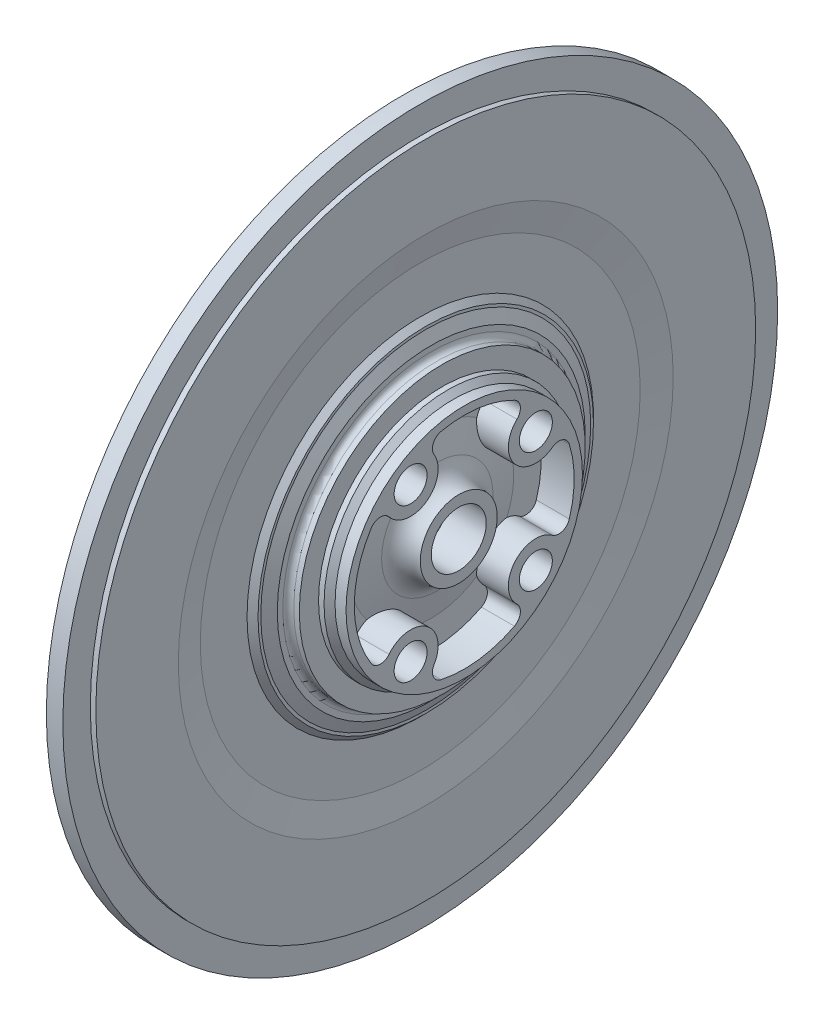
ISO-10303-21;
HEADER;
FILE_DESCRIPTION(('STEP AP214'),'2;1');
FILE_NAME('part.step','',(''),(''),'','','');
FILE_SCHEMA(('AUTOMOTIVE_DESIGN { 1 0 10303 214 1 1 1 1 }'));
ENDSEC;
DATA;
#1=APPLICATION_CONTEXT('core data for automotive mechanical design processes');
#2=APPLICATION_PROTOCOL_DEFINITION('international standard','automotive_design',2000,#1);
#3=PRODUCT_CONTEXT('',#1,'mechanical');
#4=PRODUCT('Part','Part','',(#3));
#5=PRODUCT_RELATED_PRODUCT_CATEGORY('part','',(#4));
#6=PRODUCT_DEFINITION_FORMATION('','',#4);
#7=PRODUCT_DEFINITION_CONTEXT('part definition',#1,'design');
#8=PRODUCT_DEFINITION('design','',#6,#7);
#9=PRODUCT_DEFINITION_SHAPE('','',#8);
#10=(LENGTH_UNIT() NAMED_UNIT(*) SI_UNIT(.MILLI.,.METRE.));
#11=(NAMED_UNIT(*) PLANE_ANGLE_UNIT() SI_UNIT($,.RADIAN.));
#12=(NAMED_UNIT(*) SI_UNIT($,.STERADIAN.) SOLID_ANGLE_UNIT());
#13=UNCERTAINTY_MEASURE_WITH_UNIT(LENGTH_MEASURE(1.E-05),#10,'distance_accuracy_value','');
#14=(GEOMETRIC_REPRESENTATION_CONTEXT(3) GLOBAL_UNCERTAINTY_ASSIGNED_CONTEXT((#13)) GLOBAL_UNIT_ASSIGNED_CONTEXT((#10,
#11,#12)) REPRESENTATION_CONTEXT('',''));
#15=CARTESIAN_POINT('',(0.,0.,0.));
#16=DIRECTION('',(0.,0.,1.));
#17=DIRECTION('',(1.,0.,0.));
#18=AXIS2_PLACEMENT_3D('',#15,#16,#17);
#19=CARTESIAN_POINT('',(8.,-10.9273893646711,-13.0227555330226));
#20=DIRECTION('',(1.,0.,0.));
#21=DIRECTION('',(0.,0.,-1.));
#22=AXIS2_PLACEMENT_3D('',#19,#20,#21);
#23=CYLINDRICAL_SURFACE('',#22,3.);
#24=CARTESIAN_POINT('',(13.1547005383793,-10.9273893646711,-13.0227555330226));
#25=DIRECTION('',(-1.,0.,0.));
#26=DIRECTION('',(0.,0.,1.));
#27=AXIS2_PLACEMENT_3D('',#24,#25,#26);
#28=CIRCLE('',#27,3.);
#29=CARTESIAN_POINT('',(13.1547005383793,-10.9273893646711,-10.0227555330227));
#30=VERTEX_POINT('',#29);
#31=EDGE_CURVE('E1442',#30,#30,#28,.T.);
#32=ORIENTED_EDGE('',*,*,#31,.T.);
#33=EDGE_LOOP('',(#32));
#34=FACE_BOUND('',#33,.T.);
#35=CARTESIAN_POINT('',(20.,-10.9273893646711,-13.0227555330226));
#36=DIRECTION('',(1.,0.,0.));
#37=DIRECTION('',(0.,0.,-1.));
#38=AXIS2_PLACEMENT_3D('',#35,#36,#37);
#39=CIRCLE('',#38,3.);
#40=CARTESIAN_POINT('',(20.,-10.9273893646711,-16.0227555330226));
#41=VERTEX_POINT('',#40);
#42=EDGE_CURVE('E1018',#41,#41,#39,.T.);
#43=ORIENTED_EDGE('',*,*,#42,.T.);
#44=EDGE_LOOP('',(#43));
#45=FACE_BOUND('',#44,.T.);
#46=ADVANCED_FACE('F368',(#34,#45),#23,.F.);
#47=CARTESIAN_POINT('',(8.,-13.9255847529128,9.7507994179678));
#48=DIRECTION('',(1.,0.,0.));
#49=DIRECTION('',(0.,0.,-1.));
#50=AXIS2_PLACEMENT_3D('',#47,#48,#49);
#51=CYLINDRICAL_SURFACE('',#50,3.);
#52=CARTESIAN_POINT('',(13.1547005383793,-13.9255847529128,9.7507994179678));
#53=DIRECTION('',(-1.,0.,0.));
#54=DIRECTION('',(0.,0.,1.));
#55=AXIS2_PLACEMENT_3D('',#52,#53,#54);
#56=CIRCLE('',#55,3.);
#57=CARTESIAN_POINT('',(13.1547005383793,-13.9255847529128,12.7507994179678));
#58=VERTEX_POINT('',#57);
#59=EDGE_CURVE('E376',#58,#58,#56,.T.);
#60=ORIENTED_EDGE('',*,*,#59,.T.);
#61=EDGE_LOOP('',(#60));
#62=FACE_BOUND('',#61,.T.);
#63=CARTESIAN_POINT('',(20.,-13.9255847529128,9.7507994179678));
#64=DIRECTION('',(1.,0.,0.));
#65=DIRECTION('',(0.,0.,-1.));
#66=AXIS2_PLACEMENT_3D('',#63,#64,#65);
#67=CIRCLE('',#66,3.);
#68=CARTESIAN_POINT('',(20.,-13.9255847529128,6.7507994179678));
#69=VERTEX_POINT('',#68);
#70=EDGE_CURVE('E1014',#69,#69,#67,.T.);
#71=ORIENTED_EDGE('',*,*,#70,.T.);
#72=EDGE_LOOP('',(#71));
#73=FACE_BOUND('',#72,.T.);
#74=ADVANCED_FACE('F724',(#62,#73),#51,.F.);
#75=CARTESIAN_POINT('',(8.,13.9255847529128,9.7507994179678));
#76=DIRECTION('',(1.,0.,0.));
#77=DIRECTION('',(0.,0.,-1.));
#78=AXIS2_PLACEMENT_3D('',#75,#76,#77);
#79=CYLINDRICAL_SURFACE('',#78,3.);
#80=CARTESIAN_POINT('',(13.1547005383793,13.9255847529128,9.7507994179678));
#81=DIRECTION('',(-1.,0.,0.));
#82=DIRECTION('',(0.,0.,1.));
#83=AXIS2_PLACEMENT_3D('',#80,#81,#82);
#84=CIRCLE('',#83,3.);
#85=CARTESIAN_POINT('',(13.1547005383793,13.9255847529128,12.7507994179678));
#86=VERTEX_POINT('',#85);
#87=EDGE_CURVE('E11',#86,#86,#84,.T.);
#88=ORIENTED_EDGE('',*,*,#87,.T.);
#89=EDGE_LOOP('',(#88));
#90=FACE_BOUND('',#89,.T.);
#91=CARTESIAN_POINT('',(20.,13.9255847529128,9.7507994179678));
#92=DIRECTION('',(1.,0.,0.));
#93=DIRECTION('',(0.,0.,-1.));
#94=AXIS2_PLACEMENT_3D('',#91,#92,#93);
#95=CIRCLE('',#94,3.);
#96=CARTESIAN_POINT('',(20.,13.9255847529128,6.7507994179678));
#97=VERTEX_POINT('',#96);
#98=EDGE_CURVE('E1013',#97,#97,#95,.T.);
#99=ORIENTED_EDGE('',*,*,#98,.T.);
#100=EDGE_LOOP('',(#99));
#101=FACE_BOUND('',#100,.T.);
#102=ADVANCED_FACE('F731',(#90,#101),#79,.F.);
#103=CARTESIAN_POINT('',(8.,10.9273893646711,-13.0227555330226));
#104=DIRECTION('',(1.,0.,0.));
#105=DIRECTION('',(0.,0.,-1.));
#106=AXIS2_PLACEMENT_3D('',#103,#104,#105);
#107=CYLINDRICAL_SURFACE('',#106,3.);
#108=CARTESIAN_POINT('',(13.1547005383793,10.9273893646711,-13.0227555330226));
#109=DIRECTION('',(-1.,0.,0.));
#110=DIRECTION('',(0.,0.,1.));
#111=AXIS2_PLACEMENT_3D('',#108,#109,#110);
#112=CIRCLE('',#111,3.);
#113=CARTESIAN_POINT('',(13.1547005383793,10.9273893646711,-10.0227555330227));
#114=VERTEX_POINT('',#113);
#115=EDGE_CURVE('E532',#114,#114,#112,.T.);
#116=ORIENTED_EDGE('',*,*,#115,.T.);
#117=EDGE_LOOP('',(#116));
#118=FACE_BOUND('',#117,.T.);
#119=CARTESIAN_POINT('',(20.,10.9273893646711,-13.0227555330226));
#120=DIRECTION('',(1.,0.,0.));
#121=DIRECTION('',(0.,0.,-1.));
#122=AXIS2_PLACEMENT_3D('',#119,#120,#121);
#123=CIRCLE('',#122,3.);
#124=CARTESIAN_POINT('',(20.,10.9273893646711,-16.0227555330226));
#125=VERTEX_POINT('',#124);
#126=EDGE_CURVE('E756',#125,#125,#123,.T.);
#127=ORIENTED_EDGE('',*,*,#126,.T.);
#128=EDGE_LOOP('',(#127));
#129=FACE_BOUND('',#128,.T.);
#130=ADVANCED_FACE('F738',(#118,#129),#107,.F.);
#131=CARTESIAN_POINT('',(0.,0.,0.));
#132=DIRECTION('',(-1.,0.,0.));
#133=DIRECTION('',(0.,0.,1.));
#134=AXIS2_PLACEMENT_3D('',#131,#132,#133);
#135=CYLINDRICAL_SURFACE('',#134,20.);
#136=DIRECTION('',(1.,0.,0.));
#137=VECTOR('',#136,1.);
#138=CARTESIAN_POINT('',(-500000.,19.5515216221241,4.21165077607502));
#139=LINE('',#138,#137);
#140=CARTESIAN_POINT('',(14.00000000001,19.5515216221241,4.21165077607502));
#141=VERTEX_POINT('',#140);
#142=CARTESIAN_POINT('',(19.9999999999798,19.5515216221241,4.21165077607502));
#143=VERTEX_POINT('',#142);
#144=EDGE_CURVE('E759',#141,#143,#139,.T.);
#145=ORIENTED_EDGE('',*,*,#144,.F.);
#146=CARTESIAN_POINT('',(14.,0.,0.));
#147=DIRECTION('',(-1.,0.,0.));
#148=DIRECTION('',(0.,0.,1.));
#149=AXIS2_PLACEMENT_3D('',#146,#147,#148);
#150=CIRCLE('',#149,20.);
#151=CARTESIAN_POINT('',(14.00000000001,17.7952642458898,-9.12844841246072));
#152=VERTEX_POINT('',#151);
#153=EDGE_CURVE('E584',#141,#152,#150,.T.);
#154=ORIENTED_EDGE('',*,*,#153,.T.);
#155=DIRECTION('',(1.,0.,0.));
#156=VECTOR('',#155,1.);
#157=CARTESIAN_POINT('',(-500000.,17.7952642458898,-9.12844841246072));
#158=LINE('',#157,#156);
#159=CARTESIAN_POINT('',(20.,17.7952642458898,-9.12844841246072));
#160=VERTEX_POINT('',#159);
#161=EDGE_CURVE('E644',#152,#160,#158,.T.);
#162=ORIENTED_EDGE('',*,*,#161,.T.);
#163=CARTESIAN_POINT('',(20.,0.,0.));
#164=DIRECTION('',(-1.,0.,0.));
#165=DIRECTION('',(0.,0.,1.));
#166=AXIS2_PLACEMENT_3D('',#163,#164,#165);
#167=CIRCLE('',#166,20.);
#168=EDGE_CURVE('E589',#143,#160,#167,.T.);
#169=ORIENTED_EDGE('',*,*,#168,.F.);
#170=EDGE_LOOP('',(#145,#154,#162,#169));
#171=FACE_BOUND('',#170,.T.);
#172=ADVANCED_FACE('F741',(#171),#135,.F.);
#173=CARTESIAN_POINT('',(14.,15.,0.));
#174=DIRECTION('',(-1.,0.,0.));
#175=DIRECTION('',(0.,0.,1.));
#176=AXIS2_PLACEMENT_3D('',#173,#174,#175);
#177=PLANE('',#176);
#178=CARTESIAN_POINT('',(14.,0.,0.));
#179=DIRECTION('',(-1.,0.,0.));
#180=DIRECTION('',(0.,0.,1.));
#181=AXIS2_PLACEMENT_3D('',#178,#179,#180);
#182=CIRCLE('',#181,15.);
#183=CARTESIAN_POINT('',(14.0000000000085,-9.33787639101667,11.7389975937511));
#184=VERTEX_POINT('',#183);
#185=CARTESIAN_POINT('',(14.,9.33787639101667,11.7389975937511));
#186=VERTEX_POINT('',#185);
#187=EDGE_CURVE('E894',#184,#186,#182,.T.);
#188=ORIENTED_EDGE('',*,*,#187,.T.);
#189=CARTESIAN_POINT('',(14.00000000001,13.9255847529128,9.7507994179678));
#190=DIRECTION('',(-1.,0.,0.));
#191=DIRECTION('',(0.,0.,1.));
#192=AXIS2_PLACEMENT_3D('',#189,#190,#191);
#193=CIRCLE('',#192,5.);
#194=CARTESIAN_POINT('',(14.00000000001,10.8217415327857,13.6707684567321));
#195=VERTEX_POINT('',#194);
#196=EDGE_CURVE('E755',#195,#186,#193,.F.);
#197=ORIENTED_EDGE('',*,*,#196,.F.);
#198=CARTESIAN_POINT('',(14.00000000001,9.58020424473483,15.2387560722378));
#199=DIRECTION('',(-1.,0.,0.));
#200=DIRECTION('',(0.,0.,1.));
#201=AXIS2_PLACEMENT_3D('',#198,#199,#200);
#202=CIRCLE('',#201,2.);
#203=CARTESIAN_POINT('',(14.00000000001,10.6446713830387,16.9319511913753));
#204=VERTEX_POINT('',#203);
#205=EDGE_CURVE('E770',#204,#195,#202,.T.);
#206=ORIENTED_EDGE('',*,*,#205,.F.);
#207=CARTESIAN_POINT('',(14.00000000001,-10.6446713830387,16.9319511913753));
#208=VERTEX_POINT('',#207);
#209=EDGE_CURVE('E821',#208,#204,#150,.T.);
#210=ORIENTED_EDGE('',*,*,#209,.F.);
#211=CARTESIAN_POINT('',(14.00000000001,-9.58020424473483,15.2387560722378));
#212=DIRECTION('',(-1.,0.,0.));
#213=DIRECTION('',(0.,0.,1.));
#214=AXIS2_PLACEMENT_3D('',#211,#212,#213);
#215=CIRCLE('',#214,2.);
#216=CARTESIAN_POINT('',(14.00000000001,-10.8217415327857,13.6707684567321));
#217=VERTEX_POINT('',#216);
#218=EDGE_CURVE('E806',#217,#208,#215,.T.);
#219=ORIENTED_EDGE('',*,*,#218,.F.);
#220=CARTESIAN_POINT('',(14.00000000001,-13.9255847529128,9.7507994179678));
#221=DIRECTION('',(-1.,0.,0.));
#222=DIRECTION('',(0.,0.,1.));
#223=AXIS2_PLACEMENT_3D('',#220,#221,#222);
#224=CIRCLE('',#223,5.);
#225=EDGE_CURVE('E788',#184,#217,#224,.F.);
#226=ORIENTED_EDGE('',*,*,#225,.F.);
#227=EDGE_LOOP('',(#188,#197,#206,#210,#219,#226));
#228=FACE_BOUND('',#227,.T.);
#229=ADVANCED_FACE('F817',(#228),#177,.F.);
#230=ORIENTED_EDGE('',*,*,#209,.T.);
#231=DIRECTION('',(1.,0.,0.));
#232=VECTOR('',#231,1.);
#233=CARTESIAN_POINT('',(-500000.,10.6446713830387,16.9319511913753));
#234=LINE('',#233,#232);
#235=CARTESIAN_POINT('',(20.,10.6446713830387,16.9319511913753));
#236=VERTEX_POINT('',#235);
#237=EDGE_CURVE('E776',#204,#236,#234,.T.);
#238=ORIENTED_EDGE('',*,*,#237,.T.);
#239=CARTESIAN_POINT('',(19.9999999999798,-10.6446713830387,16.9319511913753));
#240=VERTEX_POINT('',#239);
#241=EDGE_CURVE('E866',#240,#236,#167,.T.);
#242=ORIENTED_EDGE('',*,*,#241,.F.);
#243=DIRECTION('',(1.,0.,0.));
#244=VECTOR('',#243,1.);
#245=CARTESIAN_POINT('',(-500000.,-10.6446713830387,16.9319511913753));
#246=LINE('',#245,#244);
#247=EDGE_CURVE('E811',#208,#240,#246,.T.);
#248=ORIENTED_EDGE('',*,*,#247,.F.);
#249=EDGE_LOOP('',(#230,#238,#242,#248));
#250=FACE_BOUND('',#249,.T.);
#251=ADVANCED_FACE('F927',(#250),#135,.F.);
#252=CARTESIAN_POINT('',(14.00000000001,17.5963694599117,3.79048569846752));
#253=DIRECTION('',(-1.,0.,0.));
#254=DIRECTION('',(0.,0.,1.));
#255=AXIS2_PLACEMENT_3D('',#252,#253,#254);
#256=CIRCLE('',#255,2.);
#257=CARTESIAN_POINT('',(14.00000000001,16.5475738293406,5.4934324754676));
#258=VERTEX_POINT('',#257);
#259=EDGE_CURVE('E772',#258,#141,#256,.T.);
#260=ORIENTED_EDGE('',*,*,#259,.F.);
#261=CARTESIAN_POINT('',(14.0000000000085,14.2247912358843,4.75975989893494));
#262=VERTEX_POINT('',#261);
#263=EDGE_CURVE('E754',#262,#258,#193,.F.);
#264=ORIENTED_EDGE('',*,*,#263,.F.);
#265=CARTESIAN_POINT('',(14.0000000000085,12.5081767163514,-8.27922189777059));
#266=VERTEX_POINT('',#265);
#267=EDGE_CURVE('E579',#262,#266,#182,.T.);
#268=ORIENTED_EDGE('',*,*,#267,.T.);
#269=CARTESIAN_POINT('',(14.00000000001,10.9273893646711,-13.0227555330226));
#270=DIRECTION('',(-1.,0.,0.));
#271=DIRECTION('',(0.,0.,1.));
#272=AXIS2_PLACEMENT_3D('',#269,#270,#271);
#273=CIRCLE('',#272,5.);
#274=CARTESIAN_POINT('',(14.00000000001,14.5619239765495,-9.58907556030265));
#275=VERTEX_POINT('',#274);
#276=EDGE_CURVE('E650',#275,#266,#273,.F.);
#277=ORIENTED_EDGE('',*,*,#276,.F.);
#278=CARTESIAN_POINT('',(14.00000000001,16.0157378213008,-8.21560357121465));
#279=DIRECTION('',(-1.,0.,0.));
#280=DIRECTION('',(0.,0.,1.));
#281=AXIS2_PLACEMENT_3D('',#278,#279,#280);
#282=CIRCLE('',#281,2.);
#283=EDGE_CURVE('E651',#152,#275,#282,.T.);
#284=ORIENTED_EDGE('',*,*,#283,.F.);
#285=ORIENTED_EDGE('',*,*,#153,.F.);
#286=EDGE_LOOP('',(#260,#264,#268,#277,#284,#285));
#287=FACE_BOUND('',#286,.T.);
#288=ADVANCED_FACE('F898',(#287),#177,.F.);
#289=CARTESIAN_POINT('',(14.00000000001,-10.9273893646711,-13.0227555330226));
#290=DIRECTION('',(-1.,0.,0.));
#291=DIRECTION('',(0.,0.,1.));
#292=AXIS2_PLACEMENT_3D('',#289,#290,#291);
#293=CIRCLE('',#292,5.);
#294=CARTESIAN_POINT('',(14.00000000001,-6.91474439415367,-16.0058211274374));
#295=VERTEX_POINT('',#294);
#296=CARTESIAN_POINT('',(14.0000000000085,-5.98141982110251,-13.7558212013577));
#297=VERTEX_POINT('',#296);
#298=EDGE_CURVE('E695',#295,#297,#293,.F.);
#299=ORIENTED_EDGE('',*,*,#298,.F.);
#300=CARTESIAN_POINT('',(14.00000000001,-5.30968640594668,-17.1990473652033));
#301=DIRECTION('',(-1.,0.,0.));
#302=DIRECTION('',(0.,0.,1.));
#303=AXIS2_PLACEMENT_3D('',#300,#301,#302);
#304=CIRCLE('',#303,2.);
#305=CARTESIAN_POINT('',(14.00000000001,-5.89965156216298,-19.1100526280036));
#306=VERTEX_POINT('',#305);
#307=EDGE_CURVE('E699',#306,#295,#304,.T.);
#308=ORIENTED_EDGE('',*,*,#307,.F.);
#309=CARTESIAN_POINT('',(14.00000000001,5.89965156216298,-19.1100526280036));
#310=VERTEX_POINT('',#309);
#311=EDGE_CURVE('E580',#310,#306,#150,.T.);
#312=ORIENTED_EDGE('',*,*,#311,.F.);
#313=CARTESIAN_POINT('',(14.00000000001,5.30968640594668,-17.1990473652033));
#314=DIRECTION('',(-1.,0.,0.));
#315=DIRECTION('',(0.,0.,1.));
#316=AXIS2_PLACEMENT_3D('',#313,#314,#315);
#317=CIRCLE('',#316,2.);
#318=CARTESIAN_POINT('',(14.00000000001,6.91474439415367,-16.0058211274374));
#319=VERTEX_POINT('',#318);
#320=EDGE_CURVE('E654',#319,#310,#317,.T.);
#321=ORIENTED_EDGE('',*,*,#320,.F.);
#322=CARTESIAN_POINT('',(14.,5.98141982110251,-13.7558212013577));
#323=VERTEX_POINT('',#322);
#324=EDGE_CURVE('E653',#323,#319,#273,.F.);
#325=ORIENTED_EDGE('',*,*,#324,.F.);
#326=EDGE_CURVE('E575',#323,#297,#182,.T.);
#327=ORIENTED_EDGE('',*,*,#326,.T.);
#328=EDGE_LOOP('',(#299,#308,#312,#321,#325,#327));
#329=FACE_BOUND('',#328,.T.);
#330=ADVANCED_FACE('F904',(#329),#177,.F.);
#331=CARTESIAN_POINT('',(14.00000000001,-17.7952642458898,-9.12844841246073));
#332=VERTEX_POINT('',#331);
#333=CARTESIAN_POINT('',(14.00000000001,-19.5515216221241,4.21165077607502));
#334=VERTEX_POINT('',#333);
#335=EDGE_CURVE('E583',#332,#334,#150,.T.);
#336=ORIENTED_EDGE('',*,*,#335,.T.);
#337=DIRECTION('',(1.,0.,0.));
#338=VECTOR('',#337,1.);
#339=CARTESIAN_POINT('',(-500000.,-19.5515216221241,4.21165077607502));
#340=LINE('',#339,#338);
#341=CARTESIAN_POINT('',(20.,-19.5515216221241,4.21165077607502));
#342=VERTEX_POINT('',#341);
#343=EDGE_CURVE('E827',#334,#342,#340,.T.);
#344=ORIENTED_EDGE('',*,*,#343,.T.);
#345=CARTESIAN_POINT('',(19.9999999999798,-17.7952642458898,-9.12844841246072));
#346=VERTEX_POINT('',#345);
#347=EDGE_CURVE('E588',#346,#342,#167,.T.);
#348=ORIENTED_EDGE('',*,*,#347,.F.);
#349=DIRECTION('',(1.,0.,0.));
#350=VECTOR('',#349,1.);
#351=CARTESIAN_POINT('',(-500000.,-17.7952642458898,-9.12844841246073));
#352=LINE('',#351,#350);
#353=EDGE_CURVE('E861',#332,#346,#352,.T.);
#354=ORIENTED_EDGE('',*,*,#353,.F.);
#355=EDGE_LOOP('',(#336,#344,#348,#354));
#356=FACE_BOUND('',#355,.T.);
#357=ADVANCED_FACE('F865',(#356),#135,.F.);
#358=CARTESIAN_POINT('',(0.,0.,0.));
#359=DIRECTION('',(-1.,0.,0.));
#360=DIRECTION('',(0.,0.,1.));
#361=AXIS2_PLACEMENT_3D('',#358,#359,#360);
#362=CYLINDRICAL_SURFACE('',#361,65.);
#363=CARTESIAN_POINT('',(9.,0.,0.));
#364=DIRECTION('',(-1.,0.,0.));
#365=DIRECTION('',(0.,0.,1.));
#366=AXIS2_PLACEMENT_3D('',#363,#364,#365);
#367=CIRCLE('',#366,65.);
#368=CARTESIAN_POINT('',(9.,0.,65.));
#369=VERTEX_POINT('',#368);
#370=EDGE_CURVE('E1233',#369,#369,#367,.T.);
#371=ORIENTED_EDGE('',*,*,#370,.F.);
#372=EDGE_LOOP('',(#371));
#373=FACE_BOUND('',#372,.T.);
#374=CARTESIAN_POINT('',(12.,0.,0.));
#375=DIRECTION('',(-1.,0.,0.));
#376=DIRECTION('',(0.,0.,1.));
#377=AXIS2_PLACEMENT_3D('',#374,#375,#376);
#378=CIRCLE('',#377,65.);
#379=CARTESIAN_POINT('',(12.,0.,65.));
#380=VERTEX_POINT('',#379);
#381=EDGE_CURVE('E635',#380,#380,#378,.T.);
#382=ORIENTED_EDGE('',*,*,#381,.T.);
#383=EDGE_LOOP('',(#382));
#384=FACE_BOUND('',#383,.T.);
#385=ADVANCED_FACE('F370',(#373,#384),#362,.T.);
#386=CARTESIAN_POINT('',(9.,65.,0.));
#387=DIRECTION('',(1.,0.,0.));
#388=DIRECTION('',(0.,0.,-1.));
#389=AXIS2_PLACEMENT_3D('',#386,#387,#388);
#390=PLANE('',#389);
#391=CARTESIAN_POINT('',(9.,0.,0.));
#392=DIRECTION('',(-1.,0.,0.));
#393=DIRECTION('',(0.,0.,1.));
#394=AXIS2_PLACEMENT_3D('',#391,#392,#393);
#395=CIRCLE('',#394,50.5);
#396=CARTESIAN_POINT('',(9.,0.,50.5));
#397=VERTEX_POINT('',#396);
#398=EDGE_CURVE('E1235',#397,#397,#395,.T.);
#399=ORIENTED_EDGE('',*,*,#398,.F.);
#400=EDGE_LOOP('',(#399));
#401=FACE_BOUND('',#400,.T.);
#402=ORIENTED_EDGE('',*,*,#370,.T.);
#403=EDGE_LOOP('',(#402));
#404=FACE_BOUND('',#403,.T.);
#405=ADVANCED_FACE('F934',(#401,#404),#390,.F.);
#406=CARTESIAN_POINT('',(0.,0.,0.));
#407=DIRECTION('',(-1.,0.,0.));
#408=DIRECTION('',(0.,0.,1.));
#409=AXIS2_PLACEMENT_3D('',#406,#407,#408);
#410=CYLINDRICAL_SURFACE('',#409,50.5);
#411=CARTESIAN_POINT('',(8.,0.,0.));
#412=DIRECTION('',(-1.,0.,0.));
#413=DIRECTION('',(0.,0.,1.));
#414=AXIS2_PLACEMENT_3D('',#411,#412,#413);
#415=CIRCLE('',#414,50.5);
#416=CARTESIAN_POINT('',(8.,0.,50.5));
#417=VERTEX_POINT('',#416);
#418=EDGE_CURVE('E1239',#417,#417,#415,.T.);
#419=ORIENTED_EDGE('',*,*,#418,.F.);
#420=EDGE_LOOP('',(#419));
#421=FACE_BOUND('',#420,.T.);
#422=ORIENTED_EDGE('',*,*,#398,.T.);
#423=EDGE_LOOP('',(#422));
#424=FACE_BOUND('',#423,.T.);
#425=ADVANCED_FACE('F1261',(#421,#424),#410,.T.);
#426=CARTESIAN_POINT('',(8.,50.5,0.));
#427=DIRECTION('',(1.,0.,0.));
#428=DIRECTION('',(0.,0.,-1.));
#429=AXIS2_PLACEMENT_3D('',#426,#427,#428);
#430=PLANE('',#429);
#431=CARTESIAN_POINT('',(8.,0.,0.));
#432=DIRECTION('',(-1.,0.,0.));
#433=DIRECTION('',(0.,0.,1.));
#434=AXIS2_PLACEMENT_3D('',#431,#432,#433);
#435=CIRCLE('',#434,32.);
#436=CARTESIAN_POINT('',(8.,0.,32.));
#437=VERTEX_POINT('',#436);
#438=EDGE_CURVE('E1244',#437,#437,#435,.T.);
#439=ORIENTED_EDGE('',*,*,#438,.F.);
#440=EDGE_LOOP('',(#439));
#441=FACE_BOUND('',#440,.T.);
#442=ORIENTED_EDGE('',*,*,#418,.T.);
#443=EDGE_LOOP('',(#442));
#444=FACE_BOUND('',#443,.T.);
#445=ADVANCED_FACE('F1255',(#441,#444),#430,.F.);
#446=CARTESIAN_POINT('',(8.,0.,0.));
#447=DIRECTION('',(-1.,0.,0.));
#448=DIRECTION('',(0.,0.,1.));
#449=AXIS2_PLACEMENT_3D('',#446,#447,#448);
#450=CONICAL_SURFACE('',#449,32.,1.40564764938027);
#451=CARTESIAN_POINT('',(9.,0.,0.));
#452=DIRECTION('',(-1.,0.,0.));
#453=DIRECTION('',(0.,0.,1.));
#454=AXIS2_PLACEMENT_3D('',#451,#452,#453);
#455=CIRCLE('',#454,26.);
#456=CARTESIAN_POINT('',(9.,0.,26.));
#457=VERTEX_POINT('',#456);
#458=EDGE_CURVE('E552',#457,#457,#455,.T.);
#459=ORIENTED_EDGE('',*,*,#458,.F.);
#460=EDGE_LOOP('',(#459));
#461=FACE_BOUND('',#460,.T.);
#462=ORIENTED_EDGE('',*,*,#438,.T.);
#463=EDGE_LOOP('',(#462));
#464=FACE_BOUND('',#463,.T.);
#465=ADVANCED_FACE('F1252',(#461,#464),#450,.F.);
#466=CARTESIAN_POINT('',(0.,0.,0.));
#467=DIRECTION('',(-1.,0.,0.));
#468=DIRECTION('',(0.,0.,1.));
#469=AXIS2_PLACEMENT_3D('',#466,#467,#468);
#470=CYLINDRICAL_SURFACE('',#469,26.);
#471=CARTESIAN_POINT('',(10.,0.,0.));
#472=DIRECTION('',(-1.,0.,0.));
#473=DIRECTION('',(0.,0.,1.));
#474=AXIS2_PLACEMENT_3D('',#471,#472,#473);
#475=CIRCLE('',#474,26.);
#476=CARTESIAN_POINT('',(10.,0.,26.));
#477=VERTEX_POINT('',#476);
#478=EDGE_CURVE('E548',#477,#477,#475,.T.);
#479=ORIENTED_EDGE('',*,*,#478,.F.);
#480=EDGE_LOOP('',(#479));
#481=FACE_BOUND('',#480,.T.);
#482=ORIENTED_EDGE('',*,*,#458,.T.);
#483=EDGE_LOOP('',(#482));
#484=FACE_BOUND('',#483,.T.);
#485=ADVANCED_FACE('F1250',(#481,#484),#470,.F.);
#486=CARTESIAN_POINT('',(10.,26.,0.));
#487=DIRECTION('',(1.,0.,0.));
#488=DIRECTION('',(0.,0.,-1.));
#489=AXIS2_PLACEMENT_3D('',#486,#487,#488);
#490=PLANE('',#489);
#491=CARTESIAN_POINT('',(10.,0.,0.));
#492=DIRECTION('',(-1.,0.,0.));
#493=DIRECTION('',(0.,0.,1.));
#494=AXIS2_PLACEMENT_3D('',#491,#492,#493);
#495=CIRCLE('',#494,15.);
#496=CARTESIAN_POINT('',(10.,-12.5081767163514,-8.27922189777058));
#497=VERTEX_POINT('',#496);
#498=CARTESIAN_POINT('',(10.,-14.2247912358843,4.75975989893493));
#499=VERTEX_POINT('',#498);
#500=EDGE_CURVE('E541',#497,#499,#495,.T.);
#501=ORIENTED_EDGE('',*,*,#500,.F.);
#502=CARTESIAN_POINT('',(10.,-10.9273893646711,-13.0227555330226));
#503=DIRECTION('',(-1.,0.,0.));
#504=DIRECTION('',(0.,0.,1.));
#505=AXIS2_PLACEMENT_3D('',#502,#503,#504);
#506=CIRCLE('',#505,5.);
#507=CARTESIAN_POINT('',(10.,-5.98141982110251,-13.7558212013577));
#508=VERTEX_POINT('',#507);
#509=EDGE_CURVE('E382',#508,#497,#506,.T.);
#510=ORIENTED_EDGE('',*,*,#509,.F.);
#511=CARTESIAN_POINT('',(10.,5.98141982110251,-13.7558212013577));
#512=VERTEX_POINT('',#511);
#513=EDGE_CURVE('E540',#512,#508,#495,.T.);
#514=ORIENTED_EDGE('',*,*,#513,.F.);
#515=CARTESIAN_POINT('',(10.,10.9273893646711,-13.0227555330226));
#516=DIRECTION('',(-1.,0.,0.));
#517=DIRECTION('',(0.,0.,1.));
#518=AXIS2_PLACEMENT_3D('',#515,#516,#517);
#519=CIRCLE('',#518,5.);
#520=CARTESIAN_POINT('',(10.,12.5081767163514,-8.27922189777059));
#521=VERTEX_POINT('',#520);
#522=EDGE_CURVE('E1021',#521,#512,#519,.T.);
#523=ORIENTED_EDGE('',*,*,#522,.F.);
#524=CARTESIAN_POINT('',(10.,14.2247912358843,4.75975989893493));
#525=VERTEX_POINT('',#524);
#526=EDGE_CURVE('E550',#525,#521,#495,.T.);
#527=ORIENTED_EDGE('',*,*,#526,.F.);
#528=CARTESIAN_POINT('',(10.,13.9255847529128,9.7507994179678));
#529=DIRECTION('',(-1.,0.,0.));
#530=DIRECTION('',(0.,0.,1.));
#531=AXIS2_PLACEMENT_3D('',#528,#529,#530);
#532=CIRCLE('',#531,5.);
#533=CARTESIAN_POINT('',(10.,9.33787639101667,11.7389975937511));
#534=VERTEX_POINT('',#533);
#535=EDGE_CURVE('E1215',#534,#525,#532,.T.);
#536=ORIENTED_EDGE('',*,*,#535,.F.);
#537=CARTESIAN_POINT('',(10.,-9.33787639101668,11.7389975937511));
#538=VERTEX_POINT('',#537);
#539=EDGE_CURVE('E554',#538,#534,#495,.T.);
#540=ORIENTED_EDGE('',*,*,#539,.F.);
#541=CARTESIAN_POINT('',(10.,-13.9255847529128,9.7507994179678));
#542=DIRECTION('',(-1.,0.,0.));
#543=DIRECTION('',(0.,0.,1.));
#544=AXIS2_PLACEMENT_3D('',#541,#542,#543);
#545=CIRCLE('',#544,5.);
#546=EDGE_CURVE('E389',#499,#538,#545,.T.);
#547=ORIENTED_EDGE('',*,*,#546,.F.);
#548=EDGE_LOOP('',(#501,#510,#514,#523,#527,#536,#540,#547));
#549=FACE_BOUND('',#548,.T.);
#550=ORIENTED_EDGE('',*,*,#478,.T.);
#551=EDGE_LOOP('',(#550));
#552=FACE_BOUND('',#551,.T.);
#553=ADVANCED_FACE('F537',(#549,#552),#490,.F.);
#554=CARTESIAN_POINT('',(10.,0.,0.));
#555=DIRECTION('',(-1.,0.,0.));
#556=DIRECTION('',(0.,0.,1.));
#557=AXIS2_PLACEMENT_3D('',#554,#555,#556);
#558=CONICAL_SURFACE('',#557,15.,1.32581766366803);
#559=CARTESIAN_POINT('',(12.,0.,0.));
#560=DIRECTION('',(-1.,0.,0.));
#561=DIRECTION('',(0.,0.,1.));
#562=AXIS2_PLACEMENT_3D('',#559,#560,#561);
#563=CIRCLE('',#562,7.);
#564=CARTESIAN_POINT('',(12.,0.,7.));
#565=VERTEX_POINT('',#564);
#566=EDGE_CURVE('E556',#565,#565,#563,.T.);
#567=ORIENTED_EDGE('',*,*,#566,.F.);
#568=EDGE_LOOP('',(#567));
#569=FACE_BOUND('',#568,.T.);
#570=ORIENTED_EDGE('',*,*,#513,.T.);
#571=CARTESIAN_POINT('',(9.99979999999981,-5.9815413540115,-13.7566407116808));
#572=CARTESIAN_POINT('',(10.0337747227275,-5.96087137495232,-13.6174178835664));
#573=CARTESIAN_POINT('',(10.0673616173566,-5.94608784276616,-13.4772219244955));
#574=CARTESIAN_POINT('',(10.1334349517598,-5.92839925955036,-13.1958072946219));
#575=CARTESIAN_POINT('',(10.1659212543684,-5.92549568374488,-13.0545884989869));
#576=CARTESIAN_POINT('',(10.2295043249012,-5.93168209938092,-12.7718897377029));
#577=CARTESIAN_POINT('',(10.2605990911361,-5.94078882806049,-12.6304096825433));
#578=CARTESIAN_POINT('',(10.3209885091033,-5.97104942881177,-12.3483611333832));
#579=CARTESIAN_POINT('',(10.3502832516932,-5.99220269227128,-12.2077925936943));
#580=CARTESIAN_POINT('',(10.4067288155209,-6.04654759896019,-11.9283767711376));
#581=CARTESIAN_POINT('',(10.4338769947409,-6.07975380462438,-11.7895317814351));
#582=CARTESIAN_POINT('',(10.4856028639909,-6.15809384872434,-11.5146955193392));
#583=CARTESIAN_POINT('',(10.5101795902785,-6.20323213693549,-11.3787053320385));
#584=CARTESIAN_POINT('',(10.5563204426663,-6.30515707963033,-11.1108244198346));
#585=CARTESIAN_POINT('',(10.5778881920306,-6.36192951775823,-10.9789289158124));
#586=CARTESIAN_POINT('',(10.6176614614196,-6.48686758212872,-10.7200553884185));
#587=CARTESIAN_POINT('',(10.6358658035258,-6.55503718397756,-10.5930791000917));
#588=CARTESIAN_POINT('',(10.6679980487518,-6.69989278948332,-10.3492345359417));
#589=CARTESIAN_POINT('',(10.6820473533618,-6.77622307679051,-10.2321709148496));
#590=CARTESIAN_POINT('',(10.7063669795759,-6.93862678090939,-10.0045917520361));
#591=CARTESIAN_POINT('',(10.7166374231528,-7.02469988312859,-9.89407599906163));
#592=CARTESIAN_POINT('',(10.7331770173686,-7.20597995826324,-9.68049107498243));
#593=CARTESIAN_POINT('',(10.7394463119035,-7.30118660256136,-9.57742163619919));
#594=CARTESIAN_POINT('',(10.7478421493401,-7.50002178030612,-9.37956734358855));
#595=CARTESIAN_POINT('',(10.749968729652,-7.60365023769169,-9.28478241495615));
#596=CARTESIAN_POINT('',(10.7500291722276,-7.81358116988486,-9.10840706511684));
#597=CARTESIAN_POINT('',(10.7481508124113,-7.91954315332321,-9.02641092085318));
#598=CARTESIAN_POINT('',(10.7406172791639,-8.13765174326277,-8.87121565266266));
#599=CARTESIAN_POINT('',(10.7349608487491,-8.2498003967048,-8.79801946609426));
#600=CARTESIAN_POINT('',(10.7199907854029,-8.47935934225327,-8.6609888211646));
#601=CARTESIAN_POINT('',(10.7106791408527,-8.59676674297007,-8.59714929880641));
#602=CARTESIAN_POINT('',(10.6885791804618,-8.83608998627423,-8.4791585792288));
#603=CARTESIAN_POINT('',(10.6757895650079,-8.95800749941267,-8.42501101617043));
#604=CARTESIAN_POINT('',(10.6470223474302,-9.20503304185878,-8.32689637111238));
#605=CARTESIAN_POINT('',(10.6310553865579,-9.33012923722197,-8.28289633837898));
#606=CARTESIAN_POINT('',(10.5961770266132,-9.58308612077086,-8.20504155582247));
#607=CARTESIAN_POINT('',(10.5772645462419,-9.71094780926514,-8.1711905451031));
#608=CARTESIAN_POINT('',(10.5367949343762,-9.96857754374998,-8.11377377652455));
#609=CARTESIAN_POINT('',(10.5152371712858,-10.0983460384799,-8.09021048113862));
#610=CARTESIAN_POINT('',(10.4697844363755,-10.3589777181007,-8.05342603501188));
#611=CARTESIAN_POINT('',(10.4458886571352,-10.4898412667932,-8.0402084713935));
#612=CARTESIAN_POINT('',(10.3950175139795,-10.7573934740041,-8.02377358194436));
#613=CARTESIAN_POINT('',(10.3679543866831,-10.8940931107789,-8.02100559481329));
#614=CARTESIAN_POINT('',(10.3119770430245,-11.166883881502,-8.02663158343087));
#615=CARTESIAN_POINT('',(10.2830627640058,-11.3029749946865,-8.0350259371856));
#616=CARTESIAN_POINT('',(10.2237595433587,-11.5734786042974,-8.06281301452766));
#617=CARTESIAN_POINT('',(10.1933729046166,-11.7078933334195,-8.08218903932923));
#618=CARTESIAN_POINT('',(10.1314034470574,-11.9743839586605,-8.13172759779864));
#619=CARTESIAN_POINT('',(10.0998212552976,-12.1064610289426,-8.16188454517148));
#620=CARTESIAN_POINT('',(10.0565553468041,-12.2827226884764,-8.20971879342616));
#621=CARTESIAN_POINT('',(10.0452664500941,-12.3282928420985,-8.22278505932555));
#622=CARTESIAN_POINT('',(10.0226002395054,-12.4189686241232,-8.2501848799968));
#623=CARTESIAN_POINT('',(10.0112230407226,-12.4640747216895,-8.26451697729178));
#624=CARTESIAN_POINT('',(9.9998,-12.5089626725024,-8.27948389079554));
#625=B_SPLINE_CURVE_WITH_KNOTS('',3,(#571,#572,#573,#574,#575,#576,#577,#578,#579,#580,#581,
#582,#583,#584,#585,#586,#587,#588,#589,#590,#591,#592,#593,#594,#595,#596,#597,#598,#599,#600,
#601,#602,#603,#604,#605,#606,#607,#608,#609,#610,#611,#612,#613,#614,#615,#616,#617,#618,#619,
#620,#621,#622,#623,#624),.UNSPECIFIED.,.F.,.F.,(4,2,2,2,2,2,2,2,2,2,2,2,2,2,2,2,2,2,2,2,2,2,2,
2,2,2,4),(0.,0.434258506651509,0.868570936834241,1.30348925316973,1.73838559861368,
2.17380914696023,2.60939530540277,3.04445233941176,3.47966144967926,3.90049400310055,
4.32131297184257,4.74211680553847,5.16291683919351,5.56442189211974,5.96606059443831,
6.3674811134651,6.7690518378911,7.16929963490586,7.56969471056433,7.97018557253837,
8.37081523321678,8.78848801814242,9.20617494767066,9.62322843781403,10.0400661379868,
10.1862481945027,10.3322640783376),.UNSPECIFIED.);
#626=EDGE_CURVE('E527',#508,#497,#625,.T.);
#627=ORIENTED_EDGE('',*,*,#626,.T.);
#628=ORIENTED_EDGE('',*,*,#500,.T.);
#629=CARTESIAN_POINT('',(9.9998,-14.2256182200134,4.75980954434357));
#630=CARTESIAN_POINT('',(10.0337747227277,-14.085123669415,4.7513522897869));
#631=CARTESIAN_POINT('',(10.0673616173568,-13.9441727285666,4.74884389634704));
#632=CARTESIAN_POINT('',(10.13343495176,-13.6622873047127,4.75574952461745));
#633=CARTESIAN_POINT('',(10.1659212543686,-13.5213528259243,4.76516502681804));
#634=CARTESIAN_POINT('',(10.2295043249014,-13.2402690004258,4.79596672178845));
#635=CARTESIAN_POINT('',(10.2605990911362,-13.1001210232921,4.81736959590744));
#636=CARTESIAN_POINT('',(10.3209885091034,-12.8217831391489,4.87209719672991));
#637=CARTESIAN_POINT('',(10.3502832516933,-12.6835931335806,4.90542132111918));
#638=CARTESIAN_POINT('',(10.406728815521,-12.4099770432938,4.98391212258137));
#639=CARTESIAN_POINT('',(10.433876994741,-12.274554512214,5.02909310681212));
#640=CARTESIAN_POINT('',(10.485602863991,-12.0075918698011,5.13108860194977));
#641=CARTESIAN_POINT('',(10.5101795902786,-11.876053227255,5.18790745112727));
#642=CARTESIAN_POINT('',(10.5563204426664,-11.6180750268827,5.31279189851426));
#643=CARTESIAN_POINT('',(10.5778881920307,-11.4916294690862,5.38084375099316));
#644=CARTESIAN_POINT('',(10.6176614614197,-11.2446301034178,5.52786870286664));
#645=CARTESIAN_POINT('',(10.6358658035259,-11.1240783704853,5.60684561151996));
#646=CARTESIAN_POINT('',(10.6679980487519,-10.8937867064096,5.77240245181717));
#647=CARTESIAN_POINT('',(10.6820473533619,-10.7838211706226,5.85864504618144));
#648=CARTESIAN_POINT('',(10.706366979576,-10.5712624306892,6.04026558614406));
#649=CARTESIAN_POINT('',(10.7166374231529,-10.4686689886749,6.13564323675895));
#650=CARTESIAN_POINT('',(10.7331770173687,-10.2716964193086,6.33484863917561));
#651=CARTESIAN_POINT('',(10.7394463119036,-10.1773169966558,6.43867608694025));
#652=CARTESIAN_POINT('',(10.7478421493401,-9.99754522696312,6.65399877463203));
#653=CARTESIAN_POINT('',(10.7499687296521,-9.91215279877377,6.76549394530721));
#654=CARTESIAN_POINT('',(10.7500291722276,-9.75474529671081,6.98999815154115));
#655=CARTESIAN_POINT('',(10.7481508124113,-9.68229636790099,7.10270335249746));
#656=CARTESIAN_POINT('',(10.7406172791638,-9.54670108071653,7.33350813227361));
#657=CARTESIAN_POINT('',(10.7349608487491,-9.48355782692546,7.45160949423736));
#658=CARTESIAN_POINT('',(10.7199907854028,-9.36705600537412,7.69223790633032));
#659=CARTESIAN_POINT('',(10.7106791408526,-9.31369214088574,7.81476251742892));
#660=CARTESIAN_POINT('',(10.6885791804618,-9.21700880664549,8.06345863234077));
#661=CARTESIAN_POINT('',(10.6757895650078,-9.1736931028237,8.18963148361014));
#662=CARTESIAN_POINT('',(10.6470223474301,-9.09748150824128,8.44426827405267));
#663=CARTESIAN_POINT('',(10.6310553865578,-9.06455176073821,8.57272329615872));
#664=CARTESIAN_POINT('',(10.5961770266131,-9.00903988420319,8.83150309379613));
#665=CARTESIAN_POINT('',(10.5772645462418,-8.98646156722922,8.96182853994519));
#666=CARTESIAN_POINT('',(10.5367949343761,-8.95171719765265,9.22348211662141));
#667=CARTESIAN_POINT('',(10.5152371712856,-8.93955363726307,9.35481047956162));
#668=CARTESIAN_POINT('',(10.4697844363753,-8.92562471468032,9.61765635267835));
#669=CARTESIAN_POINT('',(10.445888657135,-8.92386295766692,9.74917391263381));
#670=CARTESIAN_POINT('',(10.3950175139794,-8.93080931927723,10.017140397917));
#671=CARTESIAN_POINT('',(10.3679543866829,-8.93996602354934,10.1535610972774));
#672=CARTESIAN_POINT('',(10.3119770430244,-8.96934588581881,10.4248234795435));
#673=CARTESIAN_POINT('',(10.2830627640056,-8.98956941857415,10.5596651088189));
#674=CARTESIAN_POINT('',(10.2237595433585,-9.04082670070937,10.8267175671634));
#675=CARTESIAN_POINT('',(10.1933729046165,-9.07184400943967,10.9589320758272));
#676=CARTESIAN_POINT('',(10.1314034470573,-9.14442024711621,11.2200910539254));
#677=CARTESIAN_POINT('',(10.0998212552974,-9.18597371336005,11.3490371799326));
#678=CARTESIAN_POINT('',(10.056555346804,-9.24898815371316,11.5204590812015));
#679=CARTESIAN_POINT('',(10.045266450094,-9.265976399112,11.5647170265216));
#680=CARTESIAN_POINT('',(10.0226002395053,-9.30117487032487,11.6526597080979));
#681=CARTESIAN_POINT('',(10.0112230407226,-9.31938368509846,11.6963450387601));
#682=CARTESIAN_POINT('',(9.9998,-9.33820588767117,11.7397577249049));
#683=B_SPLINE_CURVE_WITH_KNOTS('',3,(#629,#630,#631,#632,#633,#634,#635,#636,#637,#638,#639,
#640,#641,#642,#643,#644,#645,#646,#647,#648,#649,#650,#651,#652,#653,#654,#655,#656,#657,#658,
#659,#660,#661,#662,#663,#664,#665,#666,#667,#668,#669,#670,#671,#672,#673,#674,#675,#676,#677,
#678,#679,#680,#681,#682),.UNSPECIFIED.,.F.,.F.,(4,2,2,2,2,2,2,2,2,2,2,2,2,2,2,2,2,2,2,2,2,2,2,
2,2,2,4),(0.,0.434258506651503,0.868570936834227,1.30348925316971,1.73838559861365,
2.17380914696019,2.60939530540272,3.0444523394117,3.47966144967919,3.90049400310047,
4.32131297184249,4.74211680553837,5.1629168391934,5.56442189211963,5.96606059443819,
6.36748111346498,6.76905183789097,7.16929963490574,7.56969471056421,7.97018557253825,
8.37081523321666,8.78848801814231,9.20617494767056,9.62322843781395,10.0400661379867,
10.1862481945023,10.3322640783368),.UNSPECIFIED.);
#684=EDGE_CURVE('E533',#499,#538,#683,.T.);
#685=ORIENTED_EDGE('',*,*,#684,.T.);
#686=ORIENTED_EDGE('',*,*,#539,.T.);
#687=CARTESIAN_POINT('',(9.9998,9.33820588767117,11.7397577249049));
#688=CARTESIAN_POINT('',(10.0337747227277,9.28220670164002,11.6106285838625));
#689=CARTESIAN_POINT('',(10.0673616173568,9.2316415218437,11.4790359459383));
#690=CARTESIAN_POINT('',(10.13343495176,9.14172019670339,11.2117884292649));
#691=CARTESIAN_POINT('',(10.1659212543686,9.10236544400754,11.076133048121));
#692=CARTESIAN_POINT('',(10.2295043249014,9.0351732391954,10.8014658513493));
#693=CARTESIAN_POINT('',(10.2605990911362,9.00735193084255,10.662449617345));
#694=CARTESIAN_POINT('',(10.3209885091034,8.96358189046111,10.3821796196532));
#695=CARTESIAN_POINT('',(10.3502832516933,8.94763255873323,10.2409259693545));
#696=CARTESIAN_POINT('',(10.406728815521,8.92780757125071,9.95696551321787));
#697=CARTESIAN_POINT('',(10.433876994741,8.92394657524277,9.81425715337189));
#698=CARTESIAN_POINT('',(10.485602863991,8.92848438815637,9.52850981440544));
#699=CARTESIAN_POINT('',(10.5101795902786,8.93688777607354,9.38547073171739));
#700=CARTESIAN_POINT('',(10.5563204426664,8.96600702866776,9.1003375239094));
#701=CARTESIAN_POINT('',(10.5778881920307,8.98670792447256,8.95824246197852));
#702=CARTESIAN_POINT('',(10.6176614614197,9.04038742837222,8.67585348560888));
#703=CARTESIAN_POINT('',(10.6358658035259,9.07337032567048,8.53556021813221));
#704=CARTESIAN_POINT('',(10.6679980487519,9.15017847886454,8.26253306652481));
#705=CARTESIAN_POINT('',(10.6820473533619,9.19360958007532,8.12970255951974));
#706=CARTESIAN_POINT('',(10.706366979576,9.29157769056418,7.86784479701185));
#707=CARTESIAN_POINT('',(10.7166374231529,9.3461143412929,7.73881741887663));
#708=CARTESIAN_POINT('',(10.7331770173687,9.46593760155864,7.48559148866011));
#709=CARTESIAN_POINT('',(10.7394463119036,9.5312238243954,7.36139276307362));
#710=CARTESIAN_POINT('',(10.7478421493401,9.67207539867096,7.11881786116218));
#711=CARTESIAN_POINT('',(10.7499687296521,9.74764065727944,7.00044163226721));
#712=CARTESIAN_POINT('',(10.7500291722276,9.90476906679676,6.77574200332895));
#713=CARTESIAN_POINT('',(10.7481508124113,9.98589831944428,6.66911483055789));
#714=CARTESIAN_POINT('',(10.7406172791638,10.1564075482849,6.46275705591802));
#715=CARTESIAN_POINT('',(10.7349608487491,10.2457902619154,6.36302876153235));
#716=CARTESIAN_POINT('',(10.7199907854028,10.4320610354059,6.17125309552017));
#717=CARTESIAN_POINT('',(10.7106791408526,10.5289449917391,6.07920158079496));
#718=CARTESIAN_POINT('',(10.6885791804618,10.7295752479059,5.90328988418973));
#719=CARTESIAN_POINT('',(10.6757895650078,10.8333241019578,5.81943278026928));
#720=CARTESIAN_POINT('',(10.6470223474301,11.0465385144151,5.66072639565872));
#721=CARTESIAN_POINT('',(10.6310553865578,11.1559841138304,5.58584834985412));
#722=CARTESIAN_POINT('',(10.5961770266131,11.38017140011,5.44517634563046));
#723=CARTESIAN_POINT('',(10.5772645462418,11.4949150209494,5.37938574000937));
#724=CARTESIAN_POINT('',(10.5367949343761,11.7289056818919,5.25724591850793));
#725=CARTESIAN_POINT('',(10.5152371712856,11.8481537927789,5.20089896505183));
#726=CARTESIAN_POINT('',(10.4697844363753,12.0903841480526,5.09791147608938));
#727=CARTESIAN_POINT('',(10.445888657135,12.2133676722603,5.05127431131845));
#728=CARTESIAN_POINT('',(10.3950175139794,12.4675495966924,4.96615182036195));
#729=CARTESIAN_POINT('',(10.3679543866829,12.5988748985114,4.92809768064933));
#730=CARTESIAN_POINT('',(10.3119770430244,12.8638266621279,4.86292852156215));
#731=CARTESIAN_POINT('',(10.2830627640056,12.9974532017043,4.83581387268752));
#732=CARTESIAN_POINT('',(10.2237595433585,13.2659314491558,4.79264264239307));
#733=CARTESIAN_POINT('',(10.1933729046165,13.4007809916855,4.77656935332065));
#734=CARTESIAN_POINT('',(10.1314034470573,13.6710126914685,4.75544707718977));
#735=CARTESIAN_POINT('',(10.0998212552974,13.8063945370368,4.7503923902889));
#736=CARTESIAN_POINT('',(10.056555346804,13.9890306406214,4.75097685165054));
#737=CARTESIAN_POINT('',(10.045266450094,14.036429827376,4.75180347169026));
#738=CARTESIAN_POINT('',(10.0226002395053,14.1311075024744,4.75480104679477));
#739=CARTESIAN_POINT('',(10.0112230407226,14.178386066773,4.75697047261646));
#740=CARTESIAN_POINT('',(9.9998,14.2256182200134,4.75980954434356));
#741=B_SPLINE_CURVE_WITH_KNOTS('',3,(#687,#688,#689,#690,#691,#692,#693,#694,#695,#696,#697,
#698,#699,#700,#701,#702,#703,#704,#705,#706,#707,#708,#709,#710,#711,#712,#713,#714,#715,#716,
#717,#718,#719,#720,#721,#722,#723,#724,#725,#726,#727,#728,#729,#730,#731,#732,#733,#734,#735,
#736,#737,#738,#739,#740),.UNSPECIFIED.,.F.,.F.,(4,2,2,2,2,2,2,2,2,2,2,2,2,2,2,2,2,2,2,2,2,2,2,
2,2,2,4),(0.,0.434258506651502,0.868570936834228,1.30348925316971,1.73838559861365,
2.17380914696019,2.60939530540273,3.04445233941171,3.4796614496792,3.90049400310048,
4.32131297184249,4.74211680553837,5.1629168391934,5.56442189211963,5.96606059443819,
6.36748111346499,6.76905183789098,7.16929963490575,7.56969471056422,7.97018557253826,
8.37081523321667,8.78848801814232,9.20617494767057,9.62322843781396,10.0400661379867,
10.1862481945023,10.3322640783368),.UNSPECIFIED.);
#742=EDGE_CURVE('E976',#534,#525,#741,.T.);
#743=ORIENTED_EDGE('',*,*,#742,.T.);
#744=ORIENTED_EDGE('',*,*,#526,.T.);
#745=CARTESIAN_POINT('',(9.9998,12.5089626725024,-8.27948389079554));
#746=CARTESIAN_POINT('',(10.0337747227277,12.375444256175,-8.23495214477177));
#747=CARTESIAN_POINT('',(10.0673616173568,12.2399453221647,-8.19604843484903));
#748=CARTESIAN_POINT('',(10.13343495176,11.965877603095,-8.129761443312));
#749=CARTESIAN_POINT('',(10.1659212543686,11.82730843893,-8.10237959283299));
#750=CARTESIAN_POINT('',(10.2295043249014,11.5478302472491,-8.0593818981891));
#751=CARTESIAN_POINT('',(10.2605990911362,11.4069182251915,-8.04378252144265));
#752=CARTESIAN_POINT('',(10.3209885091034,11.1238999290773,-8.02460617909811));
#753=CARTESIAN_POINT('',(10.3502832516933,10.9817937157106,-8.02102860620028));
#754=CARTESIAN_POINT('',(10.406728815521,10.6971859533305,-8.02602784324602));
#755=CARTESIAN_POINT('',(10.433876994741,10.5546841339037,-8.03461939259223));
#756=CARTESIAN_POINT('',(10.485602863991,10.2704196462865,-8.06404445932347));
#757=CARTESIAN_POINT('',(10.5101795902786,10.1286572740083,-8.08488254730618));
#758=CARTESIAN_POINT('',(10.5563204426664,9.84714699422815,-8.13874198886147));
#759=CARTESIAN_POINT('',(10.5778881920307,9.70739684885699,-8.17174851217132));
#760=CARTESIAN_POINT('',(10.6176614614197,9.4307609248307,-8.2498355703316));
#761=CARTESIAN_POINT('',(10.6358658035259,9.29387616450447,-8.29492032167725));
#762=CARTESIAN_POINT('',(10.6679980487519,9.0285822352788,-8.39523208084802));
#763=CARTESIAN_POINT('',(10.6820473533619,8.90004245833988,-8.45007485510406));
#764=CARTESIAN_POINT('',(10.706366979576,8.64771962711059,-8.57049257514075));
#765=CARTESIAN_POINT('',(10.7166374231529,8.52393641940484,-8.63606717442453));
#766=CARTESIAN_POINT('',(10.7331770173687,8.2821173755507,-8.77750456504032));
#767=CARTESIAN_POINT('',(10.7394463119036,8.16408133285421,-8.85336698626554));
#768=CARTESIAN_POINT('',(10.7478421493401,7.93470552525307,-9.01482437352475));
#769=CARTESIAN_POINT('',(10.7499687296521,7.82336569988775,-9.10041925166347));
#770=CARTESIAN_POINT('',(10.7500291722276,7.61321576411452,-9.27653360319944));
#771=CARTESIAN_POINT('',(10.7481508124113,7.51406522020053,-9.36664730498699));
#772=CARTESIAN_POINT('',(10.7406172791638,7.32335355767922,-9.55449295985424));
#773=CARTESIAN_POINT('',(10.7349608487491,7.23179497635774,-9.65222743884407));
#774=CARTESIAN_POINT('',(10.7199907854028,7.05698364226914,-9.85450374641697));
#775=CARTESIAN_POINT('',(10.7106791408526,6.97372640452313,-9.95904184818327));
#776=CARTESIAN_POINT('',(10.6885791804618,6.81597018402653,-10.174240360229));
#777=CARTESIAN_POINT('',(10.6757895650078,6.74147449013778,-10.2849030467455));
#778=CARTESIAN_POINT('',(10.6470223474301,6.60195489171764,-10.5111382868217));
#779=CARTESIAN_POINT('',(10.6310553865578,6.53690059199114,-10.6266934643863));
#780=CARTESIAN_POINT('',(10.5961770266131,6.41630309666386,-10.8622880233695));
#781=CARTESIAN_POINT('',(10.5772645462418,6.3607634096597,-10.9823290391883));
#782=CARTESIAN_POINT('',(10.5367949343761,6.25948199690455,-11.2260744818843));
#783=CARTESIAN_POINT('',(10.5152371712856,6.21374261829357,-11.3497797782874));
#784=CARTESIAN_POINT('',(10.4697844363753,6.13225879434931,-11.6000643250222));
#785=CARTESIAN_POINT('',(10.445888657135,6.09651781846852,-11.7266445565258));
#786=CARTESIAN_POINT('',(10.3950175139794,6.0338726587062,-11.9872781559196));
#787=CARTESIAN_POINT('',(10.3679543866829,6.00740908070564,-12.1214203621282));
#788=CARTESIAN_POINT('',(10.3119770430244,5.96557997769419,-12.3910437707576));
#789=CARTESIAN_POINT('',(10.2830627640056,5.95021482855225,-12.5265250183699));
#790=CARTESIAN_POINT('',(10.2237595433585,5.93060729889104,-12.7977442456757));
#791=CARTESIAN_POINT('',(10.1933729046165,5.92634808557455,-12.9334815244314));
#792=CARTESIAN_POINT('',(10.1314034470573,5.9288584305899,-13.2045258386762));
#793=CARTESIAN_POINT('',(10.0998212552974,5.93562228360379,-13.3398330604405));
#794=CARTESIAN_POINT('',(10.0565553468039,5.95212230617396,-13.5217232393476));
#795=CARTESIAN_POINT('',(10.0452664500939,5.95707689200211,-13.568870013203));
#796=CARTESIAN_POINT('',(10.0226002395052,5.96831476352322,-13.6629261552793));
#797=CARTESIAN_POINT('',(10.0112230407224,5.97459653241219,-13.7098357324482));
#798=CARTESIAN_POINT('',(9.99979999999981,5.9815413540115,-13.7566407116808));
#799=B_SPLINE_CURVE_WITH_KNOTS('',3,(#745,#746,#747,#748,#749,#750,#751,#752,#753,#754,#755,
#756,#757,#758,#759,#760,#761,#762,#763,#764,#765,#766,#767,#768,#769,#770,#771,#772,#773,#774,
#775,#776,#777,#778,#779,#780,#781,#782,#783,#784,#785,#786,#787,#788,#789,#790,#791,#792,#793,
#794,#795,#796,#797,#798),.UNSPECIFIED.,.F.,.F.,(4,2,2,2,2,2,2,2,2,2,2,2,2,2,2,2,2,2,2,2,2,2,2,
2,2,2,4),(0.,0.434258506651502,0.868570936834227,1.30348925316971,1.73838559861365,
2.17380914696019,2.60939530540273,3.04445233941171,3.4796614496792,3.90049400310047,
4.32131297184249,4.74211680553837,5.1629168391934,5.56442189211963,5.96606059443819,
6.36748111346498,6.76905183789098,7.16929963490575,7.56969471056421,7.97018557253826,
8.37081523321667,8.78848801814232,9.20617494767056,9.62322843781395,10.0400661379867,
10.1862481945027,10.3322640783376),.UNSPECIFIED.);
#800=EDGE_CURVE('E547',#521,#512,#799,.T.);
#801=ORIENTED_EDGE('',*,*,#800,.T.);
#802=EDGE_LOOP('',(#570,#627,#628,#685,#686,#743,#744,#801));
#803=FACE_BOUND('',#802,.T.);
#804=ADVANCED_FACE('F545',(#569,#803),#558,.F.);
#805=CARTESIAN_POINT('',(12.,7.,0.));
#806=DIRECTION('',(1.,0.,0.));
#807=DIRECTION('',(0.,0.,-1.));
#808=AXIS2_PLACEMENT_3D('',#805,#806,#807);
#809=PLANE('',#808);
#810=CARTESIAN_POINT('',(12.,0.,0.));
#811=DIRECTION('',(-1.,0.,0.));
#812=DIRECTION('',(0.,0.,1.));
#813=AXIS2_PLACEMENT_3D('',#810,#811,#812);
#814=CIRCLE('',#813,5.);
#815=CARTESIAN_POINT('',(12.,0.,5.));
#816=VERTEX_POINT('',#815);
#817=EDGE_CURVE('E560',#816,#816,#814,.T.);
#818=ORIENTED_EDGE('',*,*,#817,.F.);
#819=EDGE_LOOP('',(#818));
#820=FACE_BOUND('',#819,.T.);
#821=ORIENTED_EDGE('',*,*,#566,.T.);
#822=EDGE_LOOP('',(#821));
#823=FACE_BOUND('',#822,.T.);
#824=ADVANCED_FACE('F956',(#820,#823),#809,.F.);
#825=CARTESIAN_POINT('',(0.,0.,0.));
#826=DIRECTION('',(-1.,0.,0.));
#827=DIRECTION('',(0.,0.,1.));
#828=AXIS2_PLACEMENT_3D('',#825,#826,#827);
#829=CYLINDRICAL_SURFACE('',#828,5.);
#830=CARTESIAN_POINT('',(19.,0.,0.));
#831=DIRECTION('',(-1.,0.,0.));
#832=DIRECTION('',(0.,0.,1.));
#833=AXIS2_PLACEMENT_3D('',#830,#831,#832);
#834=CIRCLE('',#833,5.);
#835=CARTESIAN_POINT('',(19.,0.,5.));
#836=VERTEX_POINT('',#835);
#837=EDGE_CURVE('E564',#836,#836,#834,.T.);
#838=ORIENTED_EDGE('',*,*,#837,.F.);
#839=EDGE_LOOP('',(#838));
#840=FACE_BOUND('',#839,.T.);
#841=ORIENTED_EDGE('',*,*,#817,.T.);
#842=EDGE_LOOP('',(#841));
#843=FACE_BOUND('',#842,.T.);
#844=ADVANCED_FACE('F952',(#840,#843),#829,.F.);
#845=CARTESIAN_POINT('',(19.,5.,0.));
#846=DIRECTION('',(-1.,0.,0.));
#847=DIRECTION('',(0.,0.,1.));
#848=AXIS2_PLACEMENT_3D('',#845,#846,#847);
#849=PLANE('',#848);
#850=CARTESIAN_POINT('',(19.,0.,0.));
#851=DIRECTION('',(-1.,0.,0.));
#852=DIRECTION('',(0.,0.,1.));
#853=AXIS2_PLACEMENT_3D('',#850,#851,#852);
#854=CIRCLE('',#853,7.);
#855=CARTESIAN_POINT('',(19.,0.,7.));
#856=VERTEX_POINT('',#855);
#857=EDGE_CURVE('E569',#856,#856,#854,.T.);
#858=ORIENTED_EDGE('',*,*,#857,.F.);
#859=EDGE_LOOP('',(#858));
#860=FACE_BOUND('',#859,.T.);
#861=ORIENTED_EDGE('',*,*,#837,.T.);
#862=EDGE_LOOP('',(#861));
#863=FACE_BOUND('',#862,.T.);
#864=ADVANCED_FACE('F948',(#860,#863),#849,.F.);
#865=CARTESIAN_POINT('',(19.,0.,0.));
#866=DIRECTION('',(-1.,0.,0.));
#867=DIRECTION('',(0.,0.,1.));
#868=AXIS2_PLACEMENT_3D('',#865,#866,#867);
#869=TOROIDAL_SURFACE('',#868,11.,4.);
#870=CARTESIAN_POINT('',(15.0975609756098,0.,0.));
#871=DIRECTION('',(-1.,0.,0.));
#872=DIRECTION('',(0.,0.,1.));
#873=AXIS2_PLACEMENT_3D('',#870,#871,#872);
#874=CIRCLE('',#873,10.1219512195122);
#875=CARTESIAN_POINT('',(15.0975609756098,0.,10.1219512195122));
#876=VERTEX_POINT('',#875);
#877=EDGE_CURVE('E572',#876,#876,#874,.T.);
#878=ORIENTED_EDGE('',*,*,#877,.F.);
#879=EDGE_LOOP('',(#878));
#880=FACE_BOUND('',#879,.T.);
#881=ORIENTED_EDGE('',*,*,#857,.T.);
#882=EDGE_LOOP('',(#881));
#883=FACE_BOUND('',#882,.T.);
#884=ADVANCED_FACE('F945',(#880,#883),#869,.F.);
#885=CARTESIAN_POINT('',(15.0975609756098,0.,0.));
#886=DIRECTION('',(-1.,0.,0.));
#887=DIRECTION('',(0.,0.,1.));
#888=AXIS2_PLACEMENT_3D('',#885,#886,#887);
#889=CONICAL_SURFACE('',#888,10.1219512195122,1.34948188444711);
#890=ORIENTED_EDGE('',*,*,#267,.F.);
#891=CARTESIAN_POINT('',(13.9998,9.33824250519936,11.7398421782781));
#892=CARTESIAN_POINT('',(14.0303666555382,9.28226016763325,11.6107601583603));
#893=CARTESIAN_POINT('',(14.0605804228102,9.23171642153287,11.479232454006));
#894=CARTESIAN_POINT('',(14.1200082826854,9.14183919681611,11.2121680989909));
#895=CARTESIAN_POINT('',(14.1492222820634,9.10250676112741,11.0766310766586));
#896=CARTESIAN_POINT('',(14.2063790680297,9.03536270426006,10.8023197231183));
#897=CARTESIAN_POINT('',(14.2343205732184,9.00756247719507,10.6635423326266));
#898=CARTESIAN_POINT('',(14.2885773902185,8.96379921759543,10.3838241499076));
#899=CARTESIAN_POINT('',(14.3148927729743,8.94783566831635,10.2428834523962));
#900=CARTESIAN_POINT('',(14.3655867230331,8.92792983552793,9.95965405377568));
#901=CARTESIAN_POINT('',(14.3899632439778,8.9240000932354,9.81736410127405));
#902=CARTESIAN_POINT('',(14.4364063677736,8.92832013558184,9.53253391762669));
#903=CARTESIAN_POINT('',(14.4584721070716,8.93657445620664,9.38999361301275));
#904=CARTESIAN_POINT('',(14.4999065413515,8.96529472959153,9.10590985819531));
#905=CARTESIAN_POINT('',(14.519278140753,8.98574740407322,8.96436549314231));
#906=CARTESIAN_POINT('',(14.5550158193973,9.03881009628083,8.68313073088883));
#907=CARTESIAN_POINT('',(14.5713808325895,9.07142441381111,8.54344100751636));
#908=CARTESIAN_POINT('',(14.6003838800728,9.14761309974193,8.27077097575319));
#909=CARTESIAN_POINT('',(14.6131101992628,9.19086961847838,8.13771122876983));
#910=CARTESIAN_POINT('',(14.6351547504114,9.2884945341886,7.87544032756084));
#911=CARTESIAN_POINT('',(14.6444730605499,9.34286267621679,7.74622908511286));
#912=CARTESIAN_POINT('',(14.6595052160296,9.46235239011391,7.49265837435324));
#913=CARTESIAN_POINT('',(14.6652190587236,9.52747396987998,7.36829890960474));
#914=CARTESIAN_POINT('',(14.6729164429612,9.66800193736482,7.12540931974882));
#915=CARTESIAN_POINT('',(14.6748999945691,9.74340829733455,7.00687917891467));
#916=CARTESIAN_POINT('',(14.6750890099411,9.90090447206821,6.78091792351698));
#917=CARTESIAN_POINT('',(14.6734338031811,9.98263611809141,6.67323701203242));
#918=CARTESIAN_POINT('',(14.6666613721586,10.1545189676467,6.46487366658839));
#919=CARTESIAN_POINT('',(14.6615429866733,10.2446729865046,6.36419359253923));
#920=CARTESIAN_POINT('',(14.6479513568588,10.4326545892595,6.17062751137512));
#921=CARTESIAN_POINT('',(14.6394799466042,10.5304779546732,6.07773727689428));
#922=CARTESIAN_POINT('',(14.6193451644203,10.7331547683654,5.90027470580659));
#923=CARTESIAN_POINT('',(14.6076806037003,10.8380108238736,5.81570548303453));
#924=CARTESIAN_POINT('',(14.5814165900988,11.0536401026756,5.6556917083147));
#925=CARTESIAN_POINT('',(14.5668257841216,11.1643952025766,5.58022129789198));
#926=CARTESIAN_POINT('',(14.5349343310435,11.3913588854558,5.43853747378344));
#927=CARTESIAN_POINT('',(14.5176326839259,11.5075694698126,5.37232749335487));
#928=CARTESIAN_POINT('',(14.4805941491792,11.7446368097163,5.24954515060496));
#929=CARTESIAN_POINT('',(14.4608566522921,11.8654947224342,5.19297520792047));
#930=CARTESIAN_POINT('',(14.419229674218,12.1110647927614,5.08976266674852));
#931=CARTESIAN_POINT('',(14.3973394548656,12.2357782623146,5.04312349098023));
#932=CARTESIAN_POINT('',(14.3508984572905,12.492653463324,4.9585526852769));
#933=CARTESIAN_POINT('',(14.3262812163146,12.6249229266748,4.92098464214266));
#934=CARTESIAN_POINT('',(14.2753682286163,12.8917994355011,4.85691343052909));
#935=CARTESIAN_POINT('',(14.2490724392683,13.0264065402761,4.83041054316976));
#936=CARTESIAN_POINT('',(14.1951493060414,13.2968406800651,4.78860494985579));
#937=CARTESIAN_POINT('',(14.1675242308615,13.4326653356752,4.77328383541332));
#938=CARTESIAN_POINT('',(14.1111946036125,13.7048343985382,4.75381373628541));
#939=CARTESIAN_POINT('',(14.0824906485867,13.8411784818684,4.7496586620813));
#940=CARTESIAN_POINT('',(14.0445194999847,14.0187968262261,4.75149616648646));
#941=CARTESIAN_POINT('',(14.0356181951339,14.0602421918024,4.75244105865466));
#942=CARTESIAN_POINT('',(14.0177552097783,14.1430396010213,4.75535885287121));
#943=CARTESIAN_POINT('',(14.0087935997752,14.1843916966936,4.7573307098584));
#944=CARTESIAN_POINT('',(13.9998,14.2257101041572,4.75981506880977));
#945=B_SPLINE_CURVE_WITH_KNOTS('',3,(#891,#892,#893,#894,#895,#896,#897,#898,#899,#900,#901,
#902,#903,#904,#905,#906,#907,#908,#909,#910,#911,#912,#913,#914,#915,#916,#917,#918,#919,#920,
#921,#922,#923,#924,#925,#926,#927,#928,#929,#930,#931,#932,#933,#934,#935,#936,#937,#938,#939,
#940,#941,#942,#943,#944),.UNSPECIFIED.,.F.,.F.,(4,2,2,2,2,2,2,2,2,2,2,2,2,2,2,2,2,2,2,2,2,2,2,
2,2,2,4),(0.,0.431825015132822,0.8636901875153,1.29598104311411,1.72825302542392,
2.16097535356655,2.59385881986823,3.02627193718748,3.4588380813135,3.87978778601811,
4.30072783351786,4.72166819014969,5.14260741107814,5.5477103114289,5.95294911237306,
6.35796655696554,6.7631349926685,7.16712336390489,7.57126111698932,7.9755001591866,
8.37987830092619,8.79846671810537,9.21706576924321,9.63497411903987,10.0526545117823,
10.1798489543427,10.3069142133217),.UNSPECIFIED.);
#946=EDGE_CURVE('E748',#186,#262,#945,.T.);
#947=ORIENTED_EDGE('',*,*,#946,.F.);
#948=ORIENTED_EDGE('',*,*,#187,.F.);
#949=CARTESIAN_POINT('',(13.9998,-14.2257101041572,4.75981506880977));
#950=CARTESIAN_POINT('',(14.0303666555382,-14.0852655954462,4.75135753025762));
#951=CARTESIAN_POINT('',(14.0605804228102,-13.9443830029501,4.74884706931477));
#952=CARTESIAN_POINT('',(14.1200082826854,-13.6626847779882,4.75573149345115));
#953=CARTESIAN_POINT('',(14.1492222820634,-13.5218691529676,4.76512748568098));
#954=CARTESIAN_POINT('',(14.2063790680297,-13.2411361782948,4.79585271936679));
#955=CARTESIAN_POINT('',(14.2343205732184,-13.1012198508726,4.81719371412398));
#956=CARTESIAN_POINT('',(14.2885773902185,-12.8234028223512,4.87173895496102));
#957=CARTESIAN_POINT('',(14.3148927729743,-12.6855020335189,4.90494268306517));
#958=CARTESIAN_POINT('',(14.3655867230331,-12.4125452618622,4.98310747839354));
#959=CARTESIAN_POINT('',(14.3899632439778,-12.2774923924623,5.02808075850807));
#960=CARTESIAN_POINT('',(14.4364063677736,-12.0113171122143,5.12955793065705));
#961=CARTESIAN_POINT('',(14.4584721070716,-11.8801961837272,5.18606611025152));
#962=CARTESIAN_POINT('',(14.4999065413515,-11.6230676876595,5.31021670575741));
#963=CARTESIAN_POINT('',(14.519278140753,-11.497054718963,5.37784695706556));
#964=CARTESIAN_POINT('',(14.5550158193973,-11.250928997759,5.52389753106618));
#965=CARTESIAN_POINT('',(14.5713808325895,-11.1308183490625,5.60232166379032));
#966=CARTESIAN_POINT('',(14.6003838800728,-10.900650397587,5.76717425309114));
#967=CARTESIAN_POINT('',(14.6131101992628,-10.7904097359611,5.8533311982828));
#968=CARTESIAN_POINT('',(14.6351547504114,-10.5773453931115,6.03477054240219));
#969=CARTESIAN_POINT('',(14.6444730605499,-10.4745215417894,6.13005273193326));
#970=CARTESIAN_POINT('',(14.6595052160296,-10.2771109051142,6.32906262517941));
#971=CARTESIAN_POINT('',(14.6652190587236,-10.1825241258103,6.43279033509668));
#972=CARTESIAN_POINT('',(14.6729164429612,-10.0023459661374,6.64791656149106));
#973=CARTESIAN_POINT('',(14.6748999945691,-9.91675456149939,6.75931505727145));
#974=CARTESIAN_POINT('',(14.6750890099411,-9.75828730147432,6.98459635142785));
#975=CARTESIAN_POINT('',(14.6734338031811,-9.68505421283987,7.09822801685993));
#976=CARTESIAN_POINT('',(14.6666613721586,-9.54804411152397,7.33100952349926));
#977=CARTESIAN_POINT('',(14.6615429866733,-9.48427027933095,7.45016120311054));
#978=CARTESIAN_POINT('',(14.6479513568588,-9.36667115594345,7.69300962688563));
#979=CARTESIAN_POINT('',(14.6394799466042,-9.31284044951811,7.81670385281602));
#980=CARTESIAN_POINT('',(14.6193451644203,-9.21539973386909,8.06785353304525));
#981=CARTESIAN_POINT('',(14.6076806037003,-9.17179354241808,8.19531037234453));
#982=CARTESIAN_POINT('',(14.5814165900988,-9.09517933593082,8.45266354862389));
#983=CARTESIAN_POINT('',(14.5668257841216,-9.06214082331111,8.58255169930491));
#984=CARTESIAN_POINT('',(14.5349343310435,-9.00662773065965,8.84428651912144));
#985=CARTESIAN_POINT('',(14.5176326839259,-8.98415706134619,8.97613389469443));
#986=CARTESIAN_POINT('',(14.4805941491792,-8.949861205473,9.24089835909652));
#987=CARTESIAN_POINT('',(14.4608566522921,-8.93803868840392,9.37381570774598));
#988=CARTESIAN_POINT('',(14.419229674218,-8.92504053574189,9.63987685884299));
#989=CARTESIAN_POINT('',(14.3973394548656,-8.9238685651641,9.77302072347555));
#990=CARTESIAN_POINT('',(14.3508984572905,-8.9322544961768,10.0433293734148));
#991=CARTESIAN_POINT('',(14.3262812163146,-8.94219090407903,10.1804710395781));
#992=CARTESIAN_POINT('',(14.2753682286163,-8.97326080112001,10.4531665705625));
#993=CARTESIAN_POINT('',(14.2490724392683,-8.9943945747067,10.588720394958));
#994=CARTESIAN_POINT('',(14.1951493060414,-9.0476040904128,10.8571437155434));
#995=CARTESIAN_POINT('',(14.1675242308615,-9.0796617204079,10.9900172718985));
#996=CARTESIAN_POINT('',(14.1111946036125,-9.15445311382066,11.2524316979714));
#997=CARTESIAN_POINT('',(14.0824906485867,-9.19718104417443,11.3819743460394));
#998=CARTESIAN_POINT('',(14.0445194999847,-9.2596567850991,11.5482525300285));
#999=CARTESIAN_POINT('',(14.0356181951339,-9.27471984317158,11.5868752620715));
#1000=CARTESIAN_POINT('',(14.0177552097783,-9.30578005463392,11.6636814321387));
#1001=CARTESIAN_POINT('',(14.0087935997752,-9.32177624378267,11.7018652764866));
#1002=CARTESIAN_POINT('',(13.9998,-9.33824250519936,11.7398421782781));
#1003=B_SPLINE_CURVE_WITH_KNOTS('',3,(#949,#950,#951,#952,#953,#954,#955,#956,#957,#958,#959,
#960,#961,#962,#963,#964,#965,#966,#967,#968,#969,#970,#971,#972,#973,#974,#975,#976,#977,#978,
#979,#980,#981,#982,#983,#984,#985,#986,#987,#988,#989,#990,#991,#992,#993,#994,#995,#996,#997,
#998,#999,#1000,#1001,#1002),.UNSPECIFIED.,.F.,.F.,(4,2,2,2,2,2,2,2,2,2,2,2,2,2,2,2,2,2,2,2,2,2,
2,2,2,2,4),(0.,0.431825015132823,0.863690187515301,1.29598104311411,1.72825302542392,
2.16097535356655,2.59385881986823,3.02627193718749,3.4588380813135,3.8797877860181,
4.30072783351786,4.72166819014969,5.14260741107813,5.5477103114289,5.95294911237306,
6.35796655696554,6.7631349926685,7.16712336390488,7.57126111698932,7.9755001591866,
8.37987830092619,8.79846671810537,9.21706576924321,9.63497411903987,10.0526545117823,
10.1798489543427,10.3069142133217),.UNSPECIFIED.);
#1004=CARTESIAN_POINT('',(14.,-14.2247912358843,4.75975989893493));
#1005=VERTEX_POINT('',#1004);
#1006=EDGE_CURVE('E782',#1005,#184,#1003,.T.);
#1007=ORIENTED_EDGE('',*,*,#1006,.F.);
#1008=CARTESIAN_POINT('',(14.,-12.5081767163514,-8.27922189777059));
#1009=VERTEX_POINT('',#1008);
#1010=EDGE_CURVE('E578',#1009,#1005,#182,.T.);
#1011=ORIENTED_EDGE('',*,*,#1010,.F.);
#1012=CARTESIAN_POINT('',(13.9998,-5.98155486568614,-13.7567317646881));
#1013=CARTESIAN_POINT('',(14.0303666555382,-5.96088896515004,-13.6175588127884));
#1014=CARTESIAN_POINT('',(14.0605804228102,-5.9461093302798,-13.4774311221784));
#1015=CARTESIAN_POINT('',(14.1200082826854,-5.92841593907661,-13.1962048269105));
#1016=CARTESIAN_POINT('',(14.1492222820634,-5.92550328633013,-13.0551061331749));
#1017=CARTESIAN_POINT('',(14.2063790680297,-5.93164411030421,-12.7727635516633));
#1018=CARTESIAN_POINT('',(14.2343205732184,-5.94070938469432,-12.6315196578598));
#1019=CARTESIAN_POINT('',(14.2885773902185,-5.97083371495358,-12.3500058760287));
#1020=CARTESIAN_POINT('',(14.3148927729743,-5.99189224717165,-12.2097359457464));
#1021=CARTESIAN_POINT('',(14.3655867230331,-6.04596985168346,-11.9310053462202));
#1022=CARTESIAN_POINT('',(14.3899632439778,-6.0790013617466,-11.7925467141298));
#1023=CARTESIAN_POINT('',(14.4364063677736,-6.15689367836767,-11.5185399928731));
#1024=CARTESIAN_POINT('',(14.4584721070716,-6.20175888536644,-11.3829930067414));
#1025=CARTESIAN_POINT('',(14.4999065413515,-6.30302682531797,-11.1160225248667));
#1026=CARTESIAN_POINT('',(14.519278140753,-6.35941696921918,-10.9845947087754));
#1027=CARTESIAN_POINT('',(14.5550158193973,-6.48346050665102,-10.7266764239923));
#1028=CARTESIAN_POINT('',(14.5713808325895,-6.5511178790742,-10.6001877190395));
#1029=CARTESIAN_POINT('',(14.6003838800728,-6.69528269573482,-10.3565277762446));
#1030=CARTESIAN_POINT('',(14.6131101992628,-6.77150368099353,-10.2391975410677));
#1031=CARTESIAN_POINT('',(14.6351547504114,-6.93368281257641,-10.0111304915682));
#1032=CARTESIAN_POINT('',(14.6444730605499,-7.01964073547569,-9.9003935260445));
#1033=CARTESIAN_POINT('',(14.6595052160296,-7.20068786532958,-9.68638924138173));
#1034=CARTESIAN_POINT('',(14.6652190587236,-7.29577707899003,-9.58312192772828));
#1035=CARTESIAN_POINT('',(14.6729164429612,-7.4943811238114,-9.38487991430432));
#1036=CARTESIAN_POINT('',(14.6748999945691,-7.59789593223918,-9.28990519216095));
#1037=CARTESIAN_POINT('',(14.6750890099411,-7.80850863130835,-9.11240638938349));
#1038=CARTESIAN_POINT('',(14.6734338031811,-7.91532520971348,-9.02954832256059));
#1039=CARTESIAN_POINT('',(14.6666613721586,-8.13527969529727,-8.87277134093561));
#1040=CARTESIAN_POINT('',(14.6615429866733,-8.24841971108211,-8.79885543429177));
#1041=CARTESIAN_POINT('',(14.6479513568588,-8.48009458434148,-8.66053817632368));
#1042=CARTESIAN_POINT('',(14.6394799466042,-8.59862646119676,-8.59613164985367));
#1043=CARTESIAN_POINT('',(14.6193451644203,-8.84032792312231,-8.47717258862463));
#1044=CARTESIAN_POINT('',(14.6076806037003,-8.96349922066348,-8.42262373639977));
#1045=CARTESIAN_POINT('',(14.5814165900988,-9.21319572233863,-8.32387126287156));
#1046=CARTESIAN_POINT('',(14.5668257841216,-9.33971011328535,-8.27963797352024));
#1047=CARTESIAN_POINT('',(14.5349343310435,-9.59561066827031,-8.20152443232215));
#1048=CARTESIAN_POINT('',(14.5176326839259,-9.72499787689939,-8.1676480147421));
#1049=CARTESIAN_POINT('',(14.4805941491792,-9.98576575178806,-8.11040692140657));
#1050=CARTESIAN_POINT('',(14.4608566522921,-10.1171469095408,-8.08704488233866));
#1051=CARTESIAN_POINT('',(14.419229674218,-10.3810627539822,-8.0509074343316));
#1052=CARTESIAN_POINT('',(14.3973394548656,-10.5135978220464,-8.03813567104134));
#1053=CARTESIAN_POINT('',(14.3508984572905,-10.7836087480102,-8.02293073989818));
#1054=CARTESIAN_POINT('',(14.3262812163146,-10.9210945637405,-8.02087665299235));
#1055=CARTESIAN_POINT('',(14.2753682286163,-11.1954603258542,-8.02806133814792));
#1056=CARTESIAN_POINT('',(14.2490724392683,-11.3323402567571,-8.03730039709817));
#1057=CARTESIAN_POINT('',(14.1951493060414,-11.6043796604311,-8.06691280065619));
#1058=CARTESIAN_POINT('',(14.1675242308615,-11.7395415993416,-8.08726774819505));
#1059=CARTESIAN_POINT('',(14.1111946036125,-12.0074759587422,-8.13890361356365));
#1060=CARTESIAN_POINT('',(14.0824906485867,-12.1402496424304,-8.17017856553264));
#1061=CARTESIAN_POINT('',(14.0445194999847,-12.3113402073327,-8.21792446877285));
#1062=CARTESIAN_POINT('',(14.0356181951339,-12.3511288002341,-8.22956401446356));
#1063=CARTESIAN_POINT('',(14.0177552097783,-12.4303497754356,-8.25381193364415));
#1064=CARTESIAN_POINT('',(14.0087935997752,-12.4697824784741,-8.26641931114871));
#1065=CARTESIAN_POINT('',(13.9998,-12.5090499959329,-8.27951300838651));
#1066=B_SPLINE_CURVE_WITH_KNOTS('',3,(#1012,#1013,#1014,#1015,#1016,#1017,#1018,#1019,#1020,
#1021,#1022,#1023,#1024,#1025,#1026,#1027,#1028,#1029,#1030,#1031,#1032,#1033,#1034,#1035,#1036,
#1037,#1038,#1039,#1040,#1041,#1042,#1043,#1044,#1045,#1046,#1047,#1048,#1049,#1050,#1051,#1052,
#1053,#1054,#1055,#1056,#1057,#1058,#1059,#1060,#1061,#1062,#1063,#1064,#1065),.UNSPECIFIED.,
.F.,.F.,(4,2,2,2,2,2,2,2,2,2,2,2,2,2,2,2,2,2,2,2,2,2,2,2,2,2,4),(0.,0.431825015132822,
0.863690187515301,1.29598104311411,1.72825302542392,2.16097535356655,2.59385881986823,
3.02627193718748,3.4588380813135,3.87978778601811,4.30072783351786,4.72166819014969,
5.14260741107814,5.5477103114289,5.95294911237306,6.35796655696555,6.7631349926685,
7.16712336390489,7.57126111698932,7.9755001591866,8.37987830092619,8.79846671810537,
9.21706576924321,9.63497411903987,10.0526545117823,10.1798489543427,10.3069142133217),.UNSPECIFIED.);
#1067=EDGE_CURVE('E688',#297,#1009,#1066,.T.);
#1068=ORIENTED_EDGE('',*,*,#1067,.F.);
#1069=ORIENTED_EDGE('',*,*,#326,.F.);
#1070=CARTESIAN_POINT('',(13.9998,12.5090499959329,-8.2795130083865));
#1071=CARTESIAN_POINT('',(14.0303666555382,12.3755799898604,-8.23499393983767));
#1072=CARTESIAN_POINT('',(14.0605804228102,12.2401476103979,-8.19610592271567));
#1073=CARTESIAN_POINT('',(14.1200082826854,11.9662661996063,-8.1298469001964));
#1074=CARTESIAN_POINT('',(14.1492222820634,11.8278168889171,-8.10247696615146));
#1075=CARTESIAN_POINT('',(14.2063790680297,11.5486973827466,-8.05949622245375));
#1076=CARTESIAN_POINT('',(14.2343205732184,11.4080251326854,-8.04389703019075));
#1077=CARTESIAN_POINT('',(14.2885773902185,11.1255571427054,-8.02467934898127));
#1078=CARTESIAN_POINT('',(14.3148927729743,10.9837614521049,-8.0210603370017));
#1079=CARTESIAN_POINT('',(14.3655867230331,10.6998749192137,-8.02591532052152));
#1080=CARTESIAN_POINT('',(14.3899632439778,10.5577839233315,-8.03440191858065));
#1081=CARTESIAN_POINT('',(14.4364063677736,10.2744141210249,-8.06353010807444));
#1082=CARTESIAN_POINT('',(14.4584721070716,10.1331356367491,-8.08417622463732));
#1083=CARTESIAN_POINT('',(14.4999065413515,9.85263604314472,-8.13754673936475));
#1084=CARTESIAN_POINT('',(14.519278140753,9.71341286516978,-8.17025798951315));
#1085=CARTESIAN_POINT('',(14.5550158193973,9.43787300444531,-8.2476299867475));
#1086=CARTESIAN_POINT('',(14.5713808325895,9.30155736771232,-8.29229495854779));
#1087=CARTESIAN_POINT('',(14.6003838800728,9.03656520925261,-8.39195848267));
#1088=CARTESIAN_POINT('',(14.6131101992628,8.90778184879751,-8.4466473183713));
#1089=CARTESIAN_POINT('',(14.6351547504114,8.65501753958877,-8.56675915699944));
#1090=CARTESIAN_POINT('',(14.6444730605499,8.53103648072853,-8.63218191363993));
#1091=CARTESIAN_POINT('',(14.6595052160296,8.28884489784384,-8.77331707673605));
#1092=CARTESIAN_POINT('',(14.6652190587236,8.17063437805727,-8.84902949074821));
#1093=CARTESIAN_POINT('',(14.6729164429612,7.94091687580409,-9.01019192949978));
#1094=CARTESIAN_POINT('',(14.6748999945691,7.8294098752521,-9.09564192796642));
#1095=CARTESIAN_POINT('',(14.6750890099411,7.61803516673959,-9.2722326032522));
#1096=CARTESIAN_POINT('',(14.6734338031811,7.51788739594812,-9.36303824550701));
#1097=CARTESIAN_POINT('',(14.6666613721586,7.3252975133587,-9.55242709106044));
#1098=CARTESIAN_POINT('',(14.6615429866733,7.23285799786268,-9.65101289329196));
#1099=CARTESIAN_POINT('',(14.6479513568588,7.05641217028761,-9.85514956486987));
#1100=CARTESIAN_POINT('',(14.6394799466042,6.972401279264,-9.96069660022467));
#1101=CARTESIAN_POINT('',(14.6193451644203,6.81327845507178,-10.1780690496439));
#1102=CARTESIAN_POINT('',(14.6076806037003,6.73816985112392,-10.2898967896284));
#1103=CARTESIAN_POINT('',(14.5814165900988,6.59755830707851,-10.5186516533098));
#1104=CARTESIAN_POINT('',(14.5668257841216,6.53202802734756,-10.6355629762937));
#1105=CARTESIAN_POINT('',(14.5349343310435,6.41066454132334,-10.8740115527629));
#1106=CARTESIAN_POINT('',(14.5176326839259,6.35483492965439,-10.9955505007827));
#1107=CARTESIAN_POINT('',(14.4805941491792,6.25318159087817,-11.2424169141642));
#1108=CARTESIAN_POINT('',(14.4608566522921,6.20736037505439,-11.3677453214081));
#1109=CARTESIAN_POINT('',(14.419229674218,6.12594343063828,-11.6213764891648));
#1110=CARTESIAN_POINT('',(14.3973394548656,6.09035122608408,-11.7496802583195));
#1111=CARTESIAN_POINT('',(14.3508984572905,6.0284903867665,-12.0129488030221));
#1112=CARTESIAN_POINT('',(14.3262812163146,6.00259334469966,-12.1479892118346));
#1113=CARTESIAN_POINT('',(14.2753682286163,5.96202576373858,-12.4194343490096));
#1114=CARTESIAN_POINT('',(14.2490724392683,5.94735551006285,-12.5558391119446));
#1115=CARTESIAN_POINT('',(14.1951493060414,5.92927888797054,-12.8288877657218));
#1116=CARTESIAN_POINT('',(14.1675242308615,5.92585397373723,-12.9655308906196));
#1117=CARTESIAN_POINT('',(14.1111946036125,5.93017906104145,-13.2383611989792));
#1118=CARTESIAN_POINT('',(14.0824906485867,5.93792296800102,-13.3745485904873));
#1119=CARTESIAN_POINT('',(14.0445194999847,5.95523393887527,-13.5513308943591));
#1120=CARTESIAN_POINT('',(14.0356181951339,5.95978743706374,-13.5925361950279));
#1121=CARTESIAN_POINT('',(14.0177552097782,5.96991039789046,-13.6747642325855));
#1122=CARTESIAN_POINT('',(14.0087935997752,5.97547882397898,-13.7157871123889));
#1123=CARTESIAN_POINT('',(13.9998,5.98155486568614,-13.7567317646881));
#1124=B_SPLINE_CURVE_WITH_KNOTS('',3,(#1070,#1071,#1072,#1073,#1074,#1075,#1076,#1077,#1078,
#1079,#1080,#1081,#1082,#1083,#1084,#1085,#1086,#1087,#1088,#1089,#1090,#1091,#1092,#1093,#1094,
#1095,#1096,#1097,#1098,#1099,#1100,#1101,#1102,#1103,#1104,#1105,#1106,#1107,#1108,#1109,#1110,
#1111,#1112,#1113,#1114,#1115,#1116,#1117,#1118,#1119,#1120,#1121,#1122,#1123),.UNSPECIFIED.,
.F.,.F.,(4,2,2,2,2,2,2,2,2,2,2,2,2,2,2,2,2,2,2,2,2,2,2,2,2,2,4),(0.,0.431825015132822,
0.863690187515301,1.29598104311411,1.72825302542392,2.16097535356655,2.59385881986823,
3.02627193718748,3.4588380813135,3.8797877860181,4.30072783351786,4.72166819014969,
5.14260741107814,5.5477103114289,5.95294911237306,6.35796655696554,6.7631349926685,
7.16712336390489,7.57126111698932,7.9755001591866,8.37987830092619,8.79846671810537,
9.21706576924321,9.63497411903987,10.0526545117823,10.1798489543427,10.3069142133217),.UNSPECIFIED.);
#1125=EDGE_CURVE('E665',#266,#323,#1124,.T.);
#1126=ORIENTED_EDGE('',*,*,#1125,.F.);
#1127=EDGE_LOOP('',(#890,#947,#948,#1007,#1011,#1068,#1069,#1126));
#1128=FACE_BOUND('',#1127,.T.);
#1129=ORIENTED_EDGE('',*,*,#877,.T.);
#1130=EDGE_LOOP('',(#1129));
#1131=FACE_BOUND('',#1130,.T.);
#1132=ADVANCED_FACE('F891',(#1128,#1131),#889,.T.);
#1133=CARTESIAN_POINT('',(14.00000000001,-16.5475738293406,5.4934324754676));
#1134=VERTEX_POINT('',#1133);
#1135=EDGE_CURVE('E766',#1134,#1005,#224,.F.);
#1136=ORIENTED_EDGE('',*,*,#1135,.F.);
#1137=CARTESIAN_POINT('',(14.00000000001,-17.5963694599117,3.79048569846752));
#1138=DIRECTION('',(-1.,0.,0.));
#1139=DIRECTION('',(0.,0.,1.));
#1140=AXIS2_PLACEMENT_3D('',#1137,#1138,#1139);
#1141=CIRCLE('',#1140,2.);
#1142=EDGE_CURVE('E789',#334,#1134,#1141,.T.);
#1143=ORIENTED_EDGE('',*,*,#1142,.F.);
#1144=ORIENTED_EDGE('',*,*,#335,.F.);
#1145=CARTESIAN_POINT('',(14.00000000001,-16.0157378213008,-8.21560357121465));
#1146=DIRECTION('',(-1.,0.,0.));
#1147=DIRECTION('',(0.,0.,1.));
#1148=AXIS2_PLACEMENT_3D('',#1145,#1146,#1147);
#1149=CIRCLE('',#1148,2.);
#1150=CARTESIAN_POINT('',(14.00000000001,-14.5619239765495,-9.58907556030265));
#1151=VERTEX_POINT('',#1150);
#1152=EDGE_CURVE('E844',#1151,#332,#1149,.T.);
#1153=ORIENTED_EDGE('',*,*,#1152,.F.);
#1154=EDGE_CURVE('E696',#1009,#1151,#293,.F.);
#1155=ORIENTED_EDGE('',*,*,#1154,.F.);
#1156=ORIENTED_EDGE('',*,*,#1010,.T.);
#1157=EDGE_LOOP('',(#1136,#1143,#1144,#1153,#1155,#1156));
#1158=FACE_BOUND('',#1157,.T.);
#1159=ADVANCED_FACE('F885',(#1158),#177,.F.);
#1160=ORIENTED_EDGE('',*,*,#311,.T.);
#1161=DIRECTION('',(1.,0.,0.));
#1162=VECTOR('',#1161,1.);
#1163=CARTESIAN_POINT('',(-500000.,-5.89965156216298,-19.1100526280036));
#1164=LINE('',#1163,#1162);
#1165=CARTESIAN_POINT('',(20.,-5.89965156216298,-19.1100526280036));
#1166=VERTEX_POINT('',#1165);
#1167=EDGE_CURVE('E863',#306,#1166,#1164,.T.);
#1168=ORIENTED_EDGE('',*,*,#1167,.T.);
#1169=CARTESIAN_POINT('',(19.9999999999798,5.89965156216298,-19.1100526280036));
#1170=VERTEX_POINT('',#1169);
#1171=EDGE_CURVE('E585',#1170,#1166,#167,.T.);
#1172=ORIENTED_EDGE('',*,*,#1171,.F.);
#1173=DIRECTION('',(1.,0.,0.));
#1174=VECTOR('',#1173,1.);
#1175=CARTESIAN_POINT('',(-500000.,5.89965156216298,-19.1100526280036));
#1176=LINE('',#1175,#1174);
#1177=EDGE_CURVE('E647',#310,#1170,#1176,.T.);
#1178=ORIENTED_EDGE('',*,*,#1177,.F.);
#1179=EDGE_LOOP('',(#1160,#1168,#1172,#1178));
#1180=FACE_BOUND('',#1179,.T.);
#1181=ADVANCED_FACE('F914',(#1180),#135,.F.);
#1182=CARTESIAN_POINT('',(20.,20.,0.));
#1183=DIRECTION('',(-1.,0.,0.));
#1184=DIRECTION('',(0.,0.,1.));
#1185=AXIS2_PLACEMENT_3D('',#1182,#1183,#1184);
#1186=PLANE('',#1185);
#1187=ORIENTED_EDGE('',*,*,#98,.F.);
#1188=EDGE_LOOP('',(#1187));
#1189=FACE_BOUND('',#1188,.T.);
#1190=ORIENTED_EDGE('',*,*,#70,.F.);
#1191=EDGE_LOOP('',(#1190));
#1192=FACE_BOUND('',#1191,.T.);
#1193=ORIENTED_EDGE('',*,*,#42,.F.);
#1194=EDGE_LOOP('',(#1193));
#1195=FACE_BOUND('',#1194,.T.);
#1196=ORIENTED_EDGE('',*,*,#126,.F.);
#1197=EDGE_LOOP('',(#1196));
#1198=FACE_BOUND('',#1197,.T.);
#1199=CARTESIAN_POINT('',(20.,0.,0.));
#1200=DIRECTION('',(-1.,0.,0.));
#1201=DIRECTION('',(0.,0.,1.));
#1202=AXIS2_PLACEMENT_3D('',#1199,#1200,#1201);
#1203=CIRCLE('',#1202,21.5);
#1204=CARTESIAN_POINT('',(20.,0.,21.5));
#1205=VERTEX_POINT('',#1204);
#1206=EDGE_CURVE('E590',#1205,#1205,#1203,.T.);
#1207=ORIENTED_EDGE('',*,*,#1206,.F.);
#1208=EDGE_LOOP('',(#1207));
#1209=FACE_BOUND('',#1208,.T.);
#1210=ORIENTED_EDGE('',*,*,#1171,.T.);
#1211=CARTESIAN_POINT('',(20.,-5.30968640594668,-17.1990473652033));
#1212=DIRECTION('',(-1.,0.,0.));
#1213=DIRECTION('',(0.,0.,-1.));
#1214=AXIS2_PLACEMENT_3D('',#1211,#1212,#1213);
#1215=CIRCLE('',#1214,2.);
#1216=CARTESIAN_POINT('',(20.,-6.91474439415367,-16.0058211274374));
#1217=VERTEX_POINT('',#1216);
#1218=EDGE_CURVE('E855',#1166,#1217,#1215,.T.);
#1219=ORIENTED_EDGE('',*,*,#1218,.T.);
#1220=CARTESIAN_POINT('',(20.,-10.9273893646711,-13.0227555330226));
#1221=DIRECTION('',(1.,0.,0.));
#1222=DIRECTION('',(0.,0.,1.));
#1223=AXIS2_PLACEMENT_3D('',#1220,#1221,#1222);
#1224=CIRCLE('',#1223,5.);
#1225=CARTESIAN_POINT('',(20.,-14.5619239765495,-9.58907556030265));
#1226=VERTEX_POINT('',#1225);
#1227=EDGE_CURVE('E656',#1217,#1226,#1224,.T.);
#1228=ORIENTED_EDGE('',*,*,#1227,.T.);
#1229=CARTESIAN_POINT('',(20.,-16.0157378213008,-8.21560357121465));
#1230=DIRECTION('',(-1.,0.,0.));
#1231=DIRECTION('',(0.,0.,1.));
#1232=AXIS2_PLACEMENT_3D('',#1229,#1230,#1231);
#1233=CIRCLE('',#1232,2.);
#1234=EDGE_CURVE('E853',#1226,#346,#1233,.T.);
#1235=ORIENTED_EDGE('',*,*,#1234,.T.);
#1236=ORIENTED_EDGE('',*,*,#347,.T.);
#1237=CARTESIAN_POINT('',(20.,-17.5963694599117,3.79048569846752));
#1238=DIRECTION('',(-1.,0.,0.));
#1239=DIRECTION('',(0.,0.,-1.));
#1240=AXIS2_PLACEMENT_3D('',#1237,#1238,#1239);
#1241=CIRCLE('',#1240,2.);
#1242=CARTESIAN_POINT('',(20.,-16.5475738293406,5.4934324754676));
#1243=VERTEX_POINT('',#1242);
#1244=EDGE_CURVE('E835',#342,#1243,#1241,.T.);
#1245=ORIENTED_EDGE('',*,*,#1244,.T.);
#1246=CARTESIAN_POINT('',(20.,-13.9255847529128,9.7507994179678));
#1247=DIRECTION('',(1.,0.,0.));
#1248=DIRECTION('',(0.,0.,1.));
#1249=AXIS2_PLACEMENT_3D('',#1246,#1247,#1248);
#1250=CIRCLE('',#1249,5.);
#1251=CARTESIAN_POINT('',(20.,-10.8217415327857,13.6707684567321));
#1252=VERTEX_POINT('',#1251);
#1253=EDGE_CURVE('E838',#1243,#1252,#1250,.T.);
#1254=ORIENTED_EDGE('',*,*,#1253,.T.);
#1255=CARTESIAN_POINT('',(20.,-9.58020424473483,15.2387560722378));
#1256=DIRECTION('',(-1.,0.,0.));
#1257=DIRECTION('',(0.,0.,1.));
#1258=AXIS2_PLACEMENT_3D('',#1255,#1256,#1257);
#1259=CIRCLE('',#1258,2.);
#1260=EDGE_CURVE('E808',#1252,#240,#1259,.T.);
#1261=ORIENTED_EDGE('',*,*,#1260,.T.);
#1262=ORIENTED_EDGE('',*,*,#241,.T.);
#1263=CARTESIAN_POINT('',(20.,9.58020424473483,15.2387560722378));
#1264=DIRECTION('',(-1.,0.,0.));
#1265=DIRECTION('',(0.,0.,-1.));
#1266=AXIS2_PLACEMENT_3D('',#1263,#1264,#1265);
#1267=CIRCLE('',#1266,2.);
#1268=CARTESIAN_POINT('',(20.,10.8217415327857,13.6707684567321));
#1269=VERTEX_POINT('',#1268);
#1270=EDGE_CURVE('E760',#236,#1269,#1267,.T.);
#1271=ORIENTED_EDGE('',*,*,#1270,.T.);
#1272=CARTESIAN_POINT('',(20.,13.9255847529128,9.7507994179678));
#1273=DIRECTION('',(1.,0.,0.));
#1274=DIRECTION('',(0.,0.,-1.));
#1275=AXIS2_PLACEMENT_3D('',#1272,#1273,#1274);
#1276=CIRCLE('',#1275,5.);
#1277=CARTESIAN_POINT('',(20.,16.5475738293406,5.4934324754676));
#1278=VERTEX_POINT('',#1277);
#1279=EDGE_CURVE('E764',#1269,#1278,#1276,.T.);
#1280=ORIENTED_EDGE('',*,*,#1279,.T.);
#1281=CARTESIAN_POINT('',(20.,17.5963694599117,3.79048569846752));
#1282=DIRECTION('',(-1.,0.,0.));
#1283=DIRECTION('',(0.,0.,1.));
#1284=AXIS2_PLACEMENT_3D('',#1281,#1282,#1283);
#1285=CIRCLE('',#1284,2.);
#1286=EDGE_CURVE('E763',#1278,#143,#1285,.T.);
#1287=ORIENTED_EDGE('',*,*,#1286,.T.);
#1288=ORIENTED_EDGE('',*,*,#168,.T.);
#1289=CARTESIAN_POINT('',(20.,16.0157378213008,-8.21560357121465));
#1290=DIRECTION('',(-1.,0.,0.));
#1291=DIRECTION('',(0.,0.,-1.));
#1292=AXIS2_PLACEMENT_3D('',#1289,#1290,#1291);
#1293=CIRCLE('',#1292,2.);
#1294=CARTESIAN_POINT('',(20.,14.5619239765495,-9.58907556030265));
#1295=VERTEX_POINT('',#1294);
#1296=EDGE_CURVE('E659',#160,#1295,#1293,.T.);
#1297=ORIENTED_EDGE('',*,*,#1296,.T.);
#1298=CARTESIAN_POINT('',(20.,10.9273893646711,-13.0227555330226));
#1299=DIRECTION('',(1.,0.,0.));
#1300=DIRECTION('',(0.,0.,-1.));
#1301=AXIS2_PLACEMENT_3D('',#1298,#1299,#1300);
#1302=CIRCLE('',#1301,5.);
#1303=CARTESIAN_POINT('',(20.,6.91474439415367,-16.0058211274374));
#1304=VERTEX_POINT('',#1303);
#1305=EDGE_CURVE('E641',#1295,#1304,#1302,.T.);
#1306=ORIENTED_EDGE('',*,*,#1305,.T.);
#1307=CARTESIAN_POINT('',(20.,5.30968640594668,-17.1990473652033));
#1308=DIRECTION('',(-1.,0.,0.));
#1309=DIRECTION('',(0.,0.,1.));
#1310=AXIS2_PLACEMENT_3D('',#1307,#1308,#1309);
#1311=CIRCLE('',#1310,2.);
#1312=EDGE_CURVE('E638',#1304,#1170,#1311,.T.);
#1313=ORIENTED_EDGE('',*,*,#1312,.T.);
#1314=EDGE_LOOP('',(#1210,#1219,#1228,#1235,#1236,#1245,#1254,#1261,#1262,#1271,#1280,#1287,
#1288,#1297,#1306,#1313));
#1315=FACE_BOUND('',#1314,.T.);
#1316=ADVANCED_FACE('F859',(#1189,#1192,#1195,#1198,#1209,#1315),#1186,.F.);
#1317=CARTESIAN_POINT('',(0.,0.,0.));
#1318=DIRECTION('',(-1.,0.,0.));
#1319=DIRECTION('',(0.,0.,1.));
#1320=AXIS2_PLACEMENT_3D('',#1317,#1318,#1319);
#1321=CYLINDRICAL_SURFACE('',#1320,21.5);
#1322=CARTESIAN_POINT('',(18.,0.,0.));
#1323=DIRECTION('',(-1.,0.,0.));
#1324=DIRECTION('',(0.,0.,1.));
#1325=AXIS2_PLACEMENT_3D('',#1322,#1323,#1324);
#1326=CIRCLE('',#1325,21.5);
#1327=CARTESIAN_POINT('',(18.,0.,21.5));
#1328=VERTEX_POINT('',#1327);
#1329=EDGE_CURVE('E593',#1328,#1328,#1326,.T.);
#1330=ORIENTED_EDGE('',*,*,#1329,.F.);
#1331=EDGE_LOOP('',(#1330));
#1332=FACE_BOUND('',#1331,.T.);
#1333=ORIENTED_EDGE('',*,*,#1206,.T.);
#1334=EDGE_LOOP('',(#1333));
#1335=FACE_BOUND('',#1334,.T.);
#1336=ADVANCED_FACE('F922',(#1332,#1335),#1321,.T.);
#1337=CARTESIAN_POINT('',(18.,0.,0.));
#1338=DIRECTION('',(-1.,0.,0.));
#1339=DIRECTION('',(0.,0.,1.));
#1340=AXIS2_PLACEMENT_3D('',#1337,#1338,#1339);
#1341=CONICAL_SURFACE('',#1340,21.5,0.78539816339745);
#1342=CARTESIAN_POINT('',(17.,0.,0.));
#1343=DIRECTION('',(-1.,0.,0.));
#1344=DIRECTION('',(0.,0.,1.));
#1345=AXIS2_PLACEMENT_3D('',#1342,#1343,#1344);
#1346=CIRCLE('',#1345,22.5);
#1347=CARTESIAN_POINT('',(17.,0.,22.5));
#1348=VERTEX_POINT('',#1347);
#1349=EDGE_CURVE('E596',#1348,#1348,#1346,.T.);
#1350=ORIENTED_EDGE('',*,*,#1349,.F.);
#1351=EDGE_LOOP('',(#1350));
#1352=FACE_BOUND('',#1351,.T.);
#1353=ORIENTED_EDGE('',*,*,#1329,.T.);
#1354=EDGE_LOOP('',(#1353));
#1355=FACE_BOUND('',#1354,.T.);
#1356=ADVANCED_FACE('F1034',(#1352,#1355),#1341,.T.);
#1357=CARTESIAN_POINT('',(0.,0.,0.));
#1358=DIRECTION('',(-1.,0.,0.));
#1359=DIRECTION('',(0.,0.,1.));
#1360=AXIS2_PLACEMENT_3D('',#1357,#1358,#1359);
#1361=CYLINDRICAL_SURFACE('',#1360,22.5);
#1362=CARTESIAN_POINT('',(16.,0.,0.));
#1363=DIRECTION('',(-1.,0.,0.));
#1364=DIRECTION('',(0.,0.,1.));
#1365=AXIS2_PLACEMENT_3D('',#1362,#1363,#1364);
#1366=CIRCLE('',#1365,22.5);
#1367=CARTESIAN_POINT('',(16.,0.,22.5));
#1368=VERTEX_POINT('',#1367);
#1369=EDGE_CURVE('E599',#1368,#1368,#1366,.T.);
#1370=ORIENTED_EDGE('',*,*,#1369,.F.);
#1371=EDGE_LOOP('',(#1370));
#1372=FACE_BOUND('',#1371,.T.);
#1373=ORIENTED_EDGE('',*,*,#1349,.T.);
#1374=EDGE_LOOP('',(#1373));
#1375=FACE_BOUND('',#1374,.T.);
#1376=ADVANCED_FACE('F1040',(#1372,#1375),#1361,.T.);
#1377=CARTESIAN_POINT('',(16.,22.5,0.));
#1378=DIRECTION('',(-1.,0.,0.));
#1379=DIRECTION('',(0.,0.,1.));
#1380=AXIS2_PLACEMENT_3D('',#1377,#1378,#1379);
#1381=PLANE('',#1380);
#1382=CARTESIAN_POINT('',(16.,0.,0.));
#1383=DIRECTION('',(-1.,0.,0.));
#1384=DIRECTION('',(0.,0.,1.));
#1385=AXIS2_PLACEMENT_3D('',#1382,#1383,#1384);
#1386=CIRCLE('',#1385,26.);
#1387=CARTESIAN_POINT('',(16.,0.,26.));
#1388=VERTEX_POINT('',#1387);
#1389=EDGE_CURVE('E602',#1388,#1388,#1386,.T.);
#1390=ORIENTED_EDGE('',*,*,#1389,.F.);
#1391=EDGE_LOOP('',(#1390));
#1392=FACE_BOUND('',#1391,.T.);
#1393=ORIENTED_EDGE('',*,*,#1369,.T.);
#1394=EDGE_LOOP('',(#1393));
#1395=FACE_BOUND('',#1394,.T.);
#1396=ADVANCED_FACE('F1047',(#1392,#1395),#1381,.F.);
#1397=CARTESIAN_POINT('',(0.,0.,0.));
#1398=DIRECTION('',(-1.,0.,0.));
#1399=DIRECTION('',(0.,0.,1.));
#1400=AXIS2_PLACEMENT_3D('',#1397,#1398,#1399);
#1401=CYLINDRICAL_SURFACE('',#1400,26.);
#1402=CARTESIAN_POINT('',(15.,0.,0.));
#1403=DIRECTION('',(-1.,0.,0.));
#1404=DIRECTION('',(0.,0.,1.));
#1405=AXIS2_PLACEMENT_3D('',#1402,#1403,#1404);
#1406=CIRCLE('',#1405,26.);
#1407=CARTESIAN_POINT('',(15.,0.,26.));
#1408=VERTEX_POINT('',#1407);
#1409=EDGE_CURVE('E605',#1408,#1408,#1406,.T.);
#1410=ORIENTED_EDGE('',*,*,#1409,.F.);
#1411=EDGE_LOOP('',(#1410));
#1412=FACE_BOUND('',#1411,.T.);
#1413=ORIENTED_EDGE('',*,*,#1389,.T.);
#1414=EDGE_LOOP('',(#1413));
#1415=FACE_BOUND('',#1414,.T.);
#1416=ADVANCED_FACE('F1051',(#1412,#1415),#1401,.T.);
#1417=CARTESIAN_POINT('',(15.,0.,0.));
#1418=DIRECTION('',(-1.,0.,0.));
#1419=DIRECTION('',(0.,0.,1.));
#1420=AXIS2_PLACEMENT_3D('',#1417,#1418,#1419);
#1421=TOROIDAL_SURFACE('',#1420,27.,0.999999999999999);
#1422=CARTESIAN_POINT('',(14.,0.,0.));
#1423=DIRECTION('',(-1.,0.,0.));
#1424=DIRECTION('',(0.,0.,1.));
#1425=AXIS2_PLACEMENT_3D('',#1422,#1423,#1424);
#1426=CIRCLE('',#1425,27.);
#1427=CARTESIAN_POINT('',(14.,0.,27.));
#1428=VERTEX_POINT('',#1427);
#1429=EDGE_CURVE('E608',#1428,#1428,#1426,.T.);
#1430=ORIENTED_EDGE('',*,*,#1429,.F.);
#1431=EDGE_LOOP('',(#1430));
#1432=FACE_BOUND('',#1431,.T.);
#1433=ORIENTED_EDGE('',*,*,#1409,.T.);
#1434=EDGE_LOOP('',(#1433));
#1435=FACE_BOUND('',#1434,.T.);
#1436=ADVANCED_FACE('F1055',(#1432,#1435),#1421,.F.);
#1437=CARTESIAN_POINT('',(14.,28.,0.));
#1438=DIRECTION('',(-1.,0.,0.));
#1439=DIRECTION('',(0.,0.,1.));
#1440=AXIS2_PLACEMENT_3D('',#1437,#1438,#1439);
#1441=PLANE('',#1440);
#1442=CARTESIAN_POINT('',(14.,0.,0.));
#1443=DIRECTION('',(-1.,0.,0.));
#1444=DIRECTION('',(0.,0.,1.));
#1445=AXIS2_PLACEMENT_3D('',#1442,#1443,#1444);
#1446=CIRCLE('',#1445,28.);
#1447=CARTESIAN_POINT('',(14.,0.,28.));
#1448=VERTEX_POINT('',#1447);
#1449=EDGE_CURVE('E611',#1448,#1448,#1446,.T.);
#1450=ORIENTED_EDGE('',*,*,#1449,.F.);
#1451=EDGE_LOOP('',(#1450));
#1452=FACE_BOUND('',#1451,.T.);
#1453=ORIENTED_EDGE('',*,*,#1429,.T.);
#1454=EDGE_LOOP('',(#1453));
#1455=FACE_BOUND('',#1454,.T.);
#1456=ADVANCED_FACE('F1059',(#1452,#1455),#1441,.F.);
#1457=CARTESIAN_POINT('',(14.,0.,0.));
#1458=DIRECTION('',(-1.,0.,0.));
#1459=DIRECTION('',(0.,0.,1.));
#1460=AXIS2_PLACEMENT_3D('',#1457,#1458,#1459);
#1461=CONICAL_SURFACE('',#1460,28.,1.10714871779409);
#1462=CARTESIAN_POINT('',(13.,0.,0.));
#1463=DIRECTION('',(-1.,0.,0.));
#1464=DIRECTION('',(0.,0.,1.));
#1465=AXIS2_PLACEMENT_3D('',#1462,#1463,#1464);
#1466=CIRCLE('',#1465,30.);
#1467=CARTESIAN_POINT('',(13.,0.,30.));
#1468=VERTEX_POINT('',#1467);
#1469=EDGE_CURVE('E614',#1468,#1468,#1466,.T.);
#1470=ORIENTED_EDGE('',*,*,#1469,.F.);
#1471=EDGE_LOOP('',(#1470));
#1472=FACE_BOUND('',#1471,.T.);
#1473=ORIENTED_EDGE('',*,*,#1449,.T.);
#1474=EDGE_LOOP('',(#1473));
#1475=FACE_BOUND('',#1474,.T.);
#1476=ADVANCED_FACE('F1063',(#1472,#1475),#1461,.T.);
#1477=CARTESIAN_POINT('',(13.,30.,0.));
#1478=DIRECTION('',(-1.,0.,0.));
#1479=DIRECTION('',(0.,0.,1.));
#1480=AXIS2_PLACEMENT_3D('',#1477,#1478,#1479);
#1481=PLANE('',#1480);
#1482=CARTESIAN_POINT('',(13.,0.,0.));
#1483=DIRECTION('',(-1.,0.,0.));
#1484=DIRECTION('',(0.,0.,1.));
#1485=AXIS2_PLACEMENT_3D('',#1482,#1483,#1484);
#1486=CIRCLE('',#1485,30.5);
#1487=CARTESIAN_POINT('',(13.,0.,30.5));
#1488=VERTEX_POINT('',#1487);
#1489=EDGE_CURVE('E617',#1488,#1488,#1486,.T.);
#1490=ORIENTED_EDGE('',*,*,#1489,.F.);
#1491=EDGE_LOOP('',(#1490));
#1492=FACE_BOUND('',#1491,.T.);
#1493=ORIENTED_EDGE('',*,*,#1469,.T.);
#1494=EDGE_LOOP('',(#1493));
#1495=FACE_BOUND('',#1494,.T.);
#1496=ADVANCED_FACE('F1067',(#1492,#1495),#1481,.F.);
#1497=CARTESIAN_POINT('',(13.,0.,0.));
#1498=DIRECTION('',(-1.,0.,0.));
#1499=DIRECTION('',(0.,0.,1.));
#1500=AXIS2_PLACEMENT_3D('',#1497,#1498,#1499);
#1501=CONICAL_SURFACE('',#1500,30.5,0.785398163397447);
#1502=CARTESIAN_POINT('',(12.,0.,0.));
#1503=DIRECTION('',(-1.,0.,0.));
#1504=DIRECTION('',(0.,0.,1.));
#1505=AXIS2_PLACEMENT_3D('',#1502,#1503,#1504);
#1506=CIRCLE('',#1505,31.5);
#1507=CARTESIAN_POINT('',(12.,0.,31.5));
#1508=VERTEX_POINT('',#1507);
#1509=EDGE_CURVE('E620',#1508,#1508,#1506,.T.);
#1510=ORIENTED_EDGE('',*,*,#1509,.F.);
#1511=EDGE_LOOP('',(#1510));
#1512=FACE_BOUND('',#1511,.T.);
#1513=ORIENTED_EDGE('',*,*,#1489,.T.);
#1514=EDGE_LOOP('',(#1513));
#1515=FACE_BOUND('',#1514,.T.);
#1516=ADVANCED_FACE('F1071',(#1512,#1515),#1501,.T.);
#1517=CARTESIAN_POINT('',(12.,40.,0.));
#1518=DIRECTION('',(-1.,0.,0.));
#1519=DIRECTION('',(0.,0.,1.));
#1520=AXIS2_PLACEMENT_3D('',#1517,#1518,#1519);
#1521=PLANE('',#1520);
#1522=CARTESIAN_POINT('',(12.,0.,0.));
#1523=DIRECTION('',(-1.,0.,0.));
#1524=DIRECTION('',(0.,0.,1.));
#1525=AXIS2_PLACEMENT_3D('',#1522,#1523,#1524);
#1526=CIRCLE('',#1525,40.);
#1527=CARTESIAN_POINT('',(12.,0.,40.));
#1528=VERTEX_POINT('',#1527);
#1529=EDGE_CURVE('E623',#1528,#1528,#1526,.T.);
#1530=ORIENTED_EDGE('',*,*,#1529,.F.);
#1531=EDGE_LOOP('',(#1530));
#1532=FACE_BOUND('',#1531,.T.);
#1533=ORIENTED_EDGE('',*,*,#1509,.T.);
#1534=EDGE_LOOP('',(#1533));
#1535=FACE_BOUND('',#1534,.T.);
#1536=ADVANCED_FACE('F1075',(#1532,#1535),#1521,.F.);
#1537=CARTESIAN_POINT('',(12.,0.,0.));
#1538=DIRECTION('',(1.,0.,0.));
#1539=DIRECTION('',(0.,0.,-1.));
#1540=AXIS2_PLACEMENT_3D('',#1537,#1538,#1539);
#1541=CONICAL_SURFACE('',#1540,40.,1.37340076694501);
#1542=CARTESIAN_POINT('',(13.,0.,0.));
#1543=DIRECTION('',(-1.,0.,0.));
#1544=DIRECTION('',(0.,0.,1.));
#1545=AXIS2_PLACEMENT_3D('',#1542,#1543,#1544);
#1546=CIRCLE('',#1545,45.);
#1547=CARTESIAN_POINT('',(13.,0.,45.));
#1548=VERTEX_POINT('',#1547);
#1549=EDGE_CURVE('E626',#1548,#1548,#1546,.T.);
#1550=ORIENTED_EDGE('',*,*,#1549,.F.);
#1551=EDGE_LOOP('',(#1550));
#1552=FACE_BOUND('',#1551,.T.);
#1553=ORIENTED_EDGE('',*,*,#1529,.T.);
#1554=EDGE_LOOP('',(#1553));
#1555=FACE_BOUND('',#1554,.T.);
#1556=ADVANCED_FACE('F1079',(#1552,#1555),#1541,.F.);
#1557=CARTESIAN_POINT('',(13.,45.,0.));
#1558=DIRECTION('',(-1.,0.,0.));
#1559=DIRECTION('',(0.,0.,1.));
#1560=AXIS2_PLACEMENT_3D('',#1557,#1558,#1559);
#1561=PLANE('',#1560);
#1562=CARTESIAN_POINT('',(13.,0.,0.));
#1563=DIRECTION('',(-1.,0.,0.));
#1564=DIRECTION('',(0.,0.,1.));
#1565=AXIS2_PLACEMENT_3D('',#1562,#1563,#1564);
#1566=CIRCLE('',#1565,60.);
#1567=CARTESIAN_POINT('',(13.,0.,60.));
#1568=VERTEX_POINT('',#1567);
#1569=EDGE_CURVE('E629',#1568,#1568,#1566,.T.);
#1570=ORIENTED_EDGE('',*,*,#1569,.F.);
#1571=EDGE_LOOP('',(#1570));
#1572=FACE_BOUND('',#1571,.T.);
#1573=ORIENTED_EDGE('',*,*,#1549,.T.);
#1574=EDGE_LOOP('',(#1573));
#1575=FACE_BOUND('',#1574,.T.);
#1576=ADVANCED_FACE('F1083',(#1572,#1575),#1561,.F.);
#1577=CARTESIAN_POINT('',(0.,0.,0.));
#1578=DIRECTION('',(-1.,0.,0.));
#1579=DIRECTION('',(0.,0.,1.));
#1580=AXIS2_PLACEMENT_3D('',#1577,#1578,#1579);
#1581=CYLINDRICAL_SURFACE('',#1580,60.);
#1582=CARTESIAN_POINT('',(12.,0.,0.));
#1583=DIRECTION('',(-1.,0.,0.));
#1584=DIRECTION('',(0.,0.,1.));
#1585=AXIS2_PLACEMENT_3D('',#1582,#1583,#1584);
#1586=CIRCLE('',#1585,60.);
#1587=CARTESIAN_POINT('',(12.,0.,60.));
#1588=VERTEX_POINT('',#1587);
#1589=EDGE_CURVE('E632',#1588,#1588,#1586,.T.);
#1590=ORIENTED_EDGE('',*,*,#1589,.F.);
#1591=EDGE_LOOP('',(#1590));
#1592=FACE_BOUND('',#1591,.T.);
#1593=ORIENTED_EDGE('',*,*,#1569,.T.);
#1594=EDGE_LOOP('',(#1593));
#1595=FACE_BOUND('',#1594,.T.);
#1596=ADVANCED_FACE('F1087',(#1592,#1595),#1581,.T.);
#1597=CARTESIAN_POINT('',(12.,60.,0.));
#1598=DIRECTION('',(-1.,0.,0.));
#1599=DIRECTION('',(0.,0.,1.));
#1600=AXIS2_PLACEMENT_3D('',#1597,#1598,#1599);
#1601=PLANE('',#1600);
#1602=ORIENTED_EDGE('',*,*,#381,.F.);
#1603=EDGE_LOOP('',(#1602));
#1604=FACE_BOUND('',#1603,.T.);
#1605=ORIENTED_EDGE('',*,*,#1589,.T.);
#1606=EDGE_LOOP('',(#1605));
#1607=FACE_BOUND('',#1606,.T.);
#1608=ADVANCED_FACE('F718',(#1604,#1607),#1601,.F.);
#1609=CARTESIAN_POINT('',(-500000.,10.9273893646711,-13.0227555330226));
#1610=DIRECTION('',(1.,0.,0.));
#1611=DIRECTION('',(0.,0.,-1.));
#1612=AXIS2_PLACEMENT_3D('',#1609,#1610,#1611);
#1613=CYLINDRICAL_SURFACE('',#1612,5.);
#1614=ORIENTED_EDGE('',*,*,#1125,.T.);
#1615=ORIENTED_EDGE('',*,*,#324,.T.);
#1616=DIRECTION('',(1.,0.,0.));
#1617=VECTOR('',#1616,1.);
#1618=CARTESIAN_POINT('',(-500000.,6.91474439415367,-16.0058211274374));
#1619=LINE('',#1618,#1617);
#1620=EDGE_CURVE('E639',#319,#1304,#1619,.T.);
#1621=ORIENTED_EDGE('',*,*,#1620,.T.);
#1622=ORIENTED_EDGE('',*,*,#1305,.F.);
#1623=DIRECTION('',(1.,0.,0.));
#1624=VECTOR('',#1623,1.);
#1625=CARTESIAN_POINT('',(-500000.,14.5619239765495,-9.58907556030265));
#1626=LINE('',#1625,#1624);
#1627=EDGE_CURVE('E642',#275,#1295,#1626,.T.);
#1628=ORIENTED_EDGE('',*,*,#1627,.F.);
#1629=ORIENTED_EDGE('',*,*,#276,.T.);
#1630=EDGE_LOOP('',(#1614,#1615,#1621,#1622,#1628,#1629));
#1631=FACE_BOUND('',#1630,.T.);
#1632=ADVANCED_FACE('F674',(#1631),#1613,.T.);
#1633=CARTESIAN_POINT('',(-500000.,16.0157378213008,-8.21560357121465));
#1634=DIRECTION('',(1.,0.,0.));
#1635=DIRECTION('',(0.,0.,-1.));
#1636=AXIS2_PLACEMENT_3D('',#1633,#1634,#1635);
#1637=CYLINDRICAL_SURFACE('',#1636,2.);
#1638=ORIENTED_EDGE('',*,*,#161,.F.);
#1639=ORIENTED_EDGE('',*,*,#283,.T.);
#1640=ORIENTED_EDGE('',*,*,#1627,.T.);
#1641=ORIENTED_EDGE('',*,*,#1296,.F.);
#1642=EDGE_LOOP('',(#1638,#1639,#1640,#1641));
#1643=FACE_BOUND('',#1642,.T.);
#1644=ADVANCED_FACE('F715',(#1643),#1637,.F.);
#1645=CARTESIAN_POINT('',(-500000.,5.30968640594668,-17.1990473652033));
#1646=DIRECTION('',(1.,0.,0.));
#1647=DIRECTION('',(0.,0.,-1.));
#1648=AXIS2_PLACEMENT_3D('',#1645,#1646,#1647);
#1649=CYLINDRICAL_SURFACE('',#1648,2.);
#1650=ORIENTED_EDGE('',*,*,#1620,.F.);
#1651=ORIENTED_EDGE('',*,*,#320,.T.);
#1652=ORIENTED_EDGE('',*,*,#1177,.T.);
#1653=ORIENTED_EDGE('',*,*,#1312,.F.);
#1654=EDGE_LOOP('',(#1650,#1651,#1652,#1653));
#1655=FACE_BOUND('',#1654,.T.);
#1656=ADVANCED_FACE('F708',(#1655),#1649,.F.);
#1657=CARTESIAN_POINT('',(-500000.,-5.30968640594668,-17.1990473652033));
#1658=DIRECTION('',(1.,0.,0.));
#1659=DIRECTION('',(0.,0.,-1.));
#1660=AXIS2_PLACEMENT_3D('',#1657,#1658,#1659);
#1661=CYLINDRICAL_SURFACE('',#1660,2.);
#1662=ORIENTED_EDGE('',*,*,#1167,.F.);
#1663=ORIENTED_EDGE('',*,*,#307,.T.);
#1664=DIRECTION('',(1.,0.,0.));
#1665=VECTOR('',#1664,1.);
#1666=CARTESIAN_POINT('',(-500000.,-6.91474439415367,-16.0058211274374));
#1667=LINE('',#1666,#1665);
#1668=EDGE_CURVE('E672',#295,#1217,#1667,.T.);
#1669=ORIENTED_EDGE('',*,*,#1668,.T.);
#1670=ORIENTED_EDGE('',*,*,#1218,.F.);
#1671=EDGE_LOOP('',(#1662,#1663,#1669,#1670));
#1672=FACE_BOUND('',#1671,.T.);
#1673=ADVANCED_FACE('F706',(#1672),#1661,.F.);
#1674=CARTESIAN_POINT('',(-500000.,-16.0157378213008,-8.21560357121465));
#1675=DIRECTION('',(1.,0.,0.));
#1676=DIRECTION('',(0.,0.,-1.));
#1677=AXIS2_PLACEMENT_3D('',#1674,#1675,#1676);
#1678=CYLINDRICAL_SURFACE('',#1677,2.);
#1679=DIRECTION('',(1.,0.,0.));
#1680=VECTOR('',#1679,1.);
#1681=CARTESIAN_POINT('',(-500000.,-14.5619239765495,-9.58907556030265));
#1682=LINE('',#1681,#1680);
#1683=EDGE_CURVE('E851',#1151,#1226,#1682,.T.);
#1684=ORIENTED_EDGE('',*,*,#1683,.F.);
#1685=ORIENTED_EDGE('',*,*,#1152,.T.);
#1686=ORIENTED_EDGE('',*,*,#353,.T.);
#1687=ORIENTED_EDGE('',*,*,#1234,.F.);
#1688=EDGE_LOOP('',(#1684,#1685,#1686,#1687));
#1689=FACE_BOUND('',#1688,.T.);
#1690=ADVANCED_FACE('F684',(#1689),#1678,.F.);
#1691=CARTESIAN_POINT('',(-500000.,-10.9273893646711,-13.0227555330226));
#1692=DIRECTION('',(1.,0.,0.));
#1693=DIRECTION('',(0.,0.,-1.));
#1694=AXIS2_PLACEMENT_3D('',#1691,#1692,#1693);
#1695=CYLINDRICAL_SURFACE('',#1694,5.);
#1696=ORIENTED_EDGE('',*,*,#1067,.T.);
#1697=ORIENTED_EDGE('',*,*,#1154,.T.);
#1698=ORIENTED_EDGE('',*,*,#1683,.T.);
#1699=ORIENTED_EDGE('',*,*,#1227,.F.);
#1700=ORIENTED_EDGE('',*,*,#1668,.F.);
#1701=ORIENTED_EDGE('',*,*,#298,.T.);
#1702=EDGE_LOOP('',(#1696,#1697,#1698,#1699,#1700,#1701));
#1703=FACE_BOUND('',#1702,.T.);
#1704=ADVANCED_FACE('F679',(#1703),#1695,.T.);
#1705=CARTESIAN_POINT('',(-500000.,-17.5963694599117,3.79048569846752));
#1706=DIRECTION('',(1.,0.,0.));
#1707=DIRECTION('',(0.,0.,-1.));
#1708=AXIS2_PLACEMENT_3D('',#1705,#1706,#1707);
#1709=CYLINDRICAL_SURFACE('',#1708,2.);
#1710=ORIENTED_EDGE('',*,*,#343,.F.);
#1711=ORIENTED_EDGE('',*,*,#1142,.T.);
#1712=DIRECTION('',(1.,0.,0.));
#1713=VECTOR('',#1712,1.);
#1714=CARTESIAN_POINT('',(-500000.,-16.5475738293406,5.4934324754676));
#1715=LINE('',#1714,#1713);
#1716=EDGE_CURVE('E697',#1134,#1243,#1715,.T.);
#1717=ORIENTED_EDGE('',*,*,#1716,.T.);
#1718=ORIENTED_EDGE('',*,*,#1244,.F.);
#1719=EDGE_LOOP('',(#1710,#1711,#1717,#1718));
#1720=FACE_BOUND('',#1719,.T.);
#1721=ADVANCED_FACE('F683',(#1720),#1709,.F.);
#1722=CARTESIAN_POINT('',(-500000.,-9.58020424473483,15.2387560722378));
#1723=DIRECTION('',(1.,0.,0.));
#1724=DIRECTION('',(0.,0.,-1.));
#1725=AXIS2_PLACEMENT_3D('',#1722,#1723,#1724);
#1726=CYLINDRICAL_SURFACE('',#1725,2.);
#1727=DIRECTION('',(1.,0.,0.));
#1728=VECTOR('',#1727,1.);
#1729=CARTESIAN_POINT('',(-500000.,-10.8217415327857,13.6707684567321));
#1730=LINE('',#1729,#1728);
#1731=EDGE_CURVE('E803',#217,#1252,#1730,.T.);
#1732=ORIENTED_EDGE('',*,*,#1731,.F.);
#1733=ORIENTED_EDGE('',*,*,#218,.T.);
#1734=ORIENTED_EDGE('',*,*,#247,.T.);
#1735=ORIENTED_EDGE('',*,*,#1260,.F.);
#1736=EDGE_LOOP('',(#1732,#1733,#1734,#1735));
#1737=FACE_BOUND('',#1736,.T.);
#1738=ADVANCED_FACE('F721',(#1737),#1726,.F.);
#1739=CARTESIAN_POINT('',(-500000.,-13.9255847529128,9.7507994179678));
#1740=DIRECTION('',(1.,0.,0.));
#1741=DIRECTION('',(0.,0.,-1.));
#1742=AXIS2_PLACEMENT_3D('',#1739,#1740,#1741);
#1743=CYLINDRICAL_SURFACE('',#1742,5.);
#1744=ORIENTED_EDGE('',*,*,#1716,.F.);
#1745=ORIENTED_EDGE('',*,*,#1135,.T.);
#1746=ORIENTED_EDGE('',*,*,#1006,.T.);
#1747=ORIENTED_EDGE('',*,*,#225,.T.);
#1748=ORIENTED_EDGE('',*,*,#1731,.T.);
#1749=ORIENTED_EDGE('',*,*,#1253,.F.);
#1750=EDGE_LOOP('',(#1744,#1745,#1746,#1747,#1748,#1749));
#1751=FACE_BOUND('',#1750,.T.);
#1752=ADVANCED_FACE('F703',(#1751),#1743,.T.);
#1753=CARTESIAN_POINT('',(-500000.,13.9255847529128,9.7507994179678));
#1754=DIRECTION('',(1.,0.,0.));
#1755=DIRECTION('',(0.,0.,-1.));
#1756=AXIS2_PLACEMENT_3D('',#1753,#1754,#1755);
#1757=CYLINDRICAL_SURFACE('',#1756,5.);
#1758=DIRECTION('',(1.,0.,0.));
#1759=VECTOR('',#1758,1.);
#1760=CARTESIAN_POINT('',(-500000.,10.8217415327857,13.6707684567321));
#1761=LINE('',#1760,#1759);
#1762=EDGE_CURVE('E779',#195,#1269,#1761,.T.);
#1763=ORIENTED_EDGE('',*,*,#1762,.F.);
#1764=ORIENTED_EDGE('',*,*,#196,.T.);
#1765=ORIENTED_EDGE('',*,*,#946,.T.);
#1766=ORIENTED_EDGE('',*,*,#263,.T.);
#1767=DIRECTION('',(1.,0.,0.));
#1768=VECTOR('',#1767,1.);
#1769=CARTESIAN_POINT('',(-500000.,16.5475738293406,5.4934324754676));
#1770=LINE('',#1769,#1768);
#1771=EDGE_CURVE('E769',#258,#1278,#1770,.T.);
#1772=ORIENTED_EDGE('',*,*,#1771,.T.);
#1773=ORIENTED_EDGE('',*,*,#1279,.F.);
#1774=EDGE_LOOP('',(#1763,#1764,#1765,#1766,#1772,#1773));
#1775=FACE_BOUND('',#1774,.T.);
#1776=ADVANCED_FACE('F720',(#1775),#1757,.T.);
#1777=CARTESIAN_POINT('',(-500000.,9.58020424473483,15.2387560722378));
#1778=DIRECTION('',(1.,0.,0.));
#1779=DIRECTION('',(0.,0.,-1.));
#1780=AXIS2_PLACEMENT_3D('',#1777,#1778,#1779);
#1781=CYLINDRICAL_SURFACE('',#1780,2.);
#1782=ORIENTED_EDGE('',*,*,#237,.F.);
#1783=ORIENTED_EDGE('',*,*,#205,.T.);
#1784=ORIENTED_EDGE('',*,*,#1762,.T.);
#1785=ORIENTED_EDGE('',*,*,#1270,.F.);
#1786=EDGE_LOOP('',(#1782,#1783,#1784,#1785));
#1787=FACE_BOUND('',#1786,.T.);
#1788=ADVANCED_FACE('F1137',(#1787),#1781,.F.);
#1789=CARTESIAN_POINT('',(-500000.,17.5963694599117,3.79048569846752));
#1790=DIRECTION('',(1.,0.,0.));
#1791=DIRECTION('',(0.,0.,-1.));
#1792=AXIS2_PLACEMENT_3D('',#1789,#1790,#1791);
#1793=CYLINDRICAL_SURFACE('',#1792,2.);
#1794=ORIENTED_EDGE('',*,*,#1771,.F.);
#1795=ORIENTED_EDGE('',*,*,#259,.T.);
#1796=ORIENTED_EDGE('',*,*,#144,.T.);
#1797=ORIENTED_EDGE('',*,*,#1286,.F.);
#1798=EDGE_LOOP('',(#1794,#1795,#1796,#1797));
#1799=FACE_BOUND('',#1798,.T.);
#1800=ADVANCED_FACE('F794',(#1799),#1793,.F.);
#1801=CARTESIAN_POINT('',(12.,10.9273893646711,-13.0227555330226));
#1802=DIRECTION('',(-1.,0.,0.));
#1803=DIRECTION('',(0.,0.,1.));
#1804=AXIS2_PLACEMENT_3D('',#1801,#1802,#1803);
#1805=CYLINDRICAL_SURFACE('',#1804,5.);
#1806=CARTESIAN_POINT('',(12.,10.9273893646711,-13.0227555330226));
#1807=DIRECTION('',(-1.,0.,0.));
#1808=DIRECTION('',(0.,0.,1.));
#1809=AXIS2_PLACEMENT_3D('',#1806,#1807,#1808);
#1810=CIRCLE('',#1809,5.);
#1811=CARTESIAN_POINT('',(12.,10.9273893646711,-8.02275553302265));
#1812=VERTEX_POINT('',#1811);
#1813=EDGE_CURVE('E1015',#1812,#1812,#1810,.T.);
#1814=ORIENTED_EDGE('',*,*,#1813,.F.);
#1815=EDGE_LOOP('',(#1814));
#1816=FACE_BOUND('',#1815,.T.);
#1817=ORIENTED_EDGE('',*,*,#522,.T.);
#1818=ORIENTED_EDGE('',*,*,#800,.F.);
#1819=EDGE_LOOP('',(#1817,#1818));
#1820=FACE_BOUND('',#1819,.T.);
#1821=ADVANCED_FACE('F1000',(#1816,#1820),#1805,.F.);
#1822=CARTESIAN_POINT('',(12.,13.9255847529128,9.7507994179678));
#1823=DIRECTION('',(-1.,0.,0.));
#1824=DIRECTION('',(0.,0.,1.));
#1825=AXIS2_PLACEMENT_3D('',#1822,#1823,#1824);
#1826=CYLINDRICAL_SURFACE('',#1825,5.);
#1827=CARTESIAN_POINT('',(12.,13.9255847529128,9.7507994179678));
#1828=DIRECTION('',(-1.,0.,0.));
#1829=DIRECTION('',(0.,0.,1.));
#1830=AXIS2_PLACEMENT_3D('',#1827,#1828,#1829);
#1831=CIRCLE('',#1830,5.);
#1832=CARTESIAN_POINT('',(12.,13.9255847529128,14.7507994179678));
#1833=VERTEX_POINT('',#1832);
#1834=EDGE_CURVE('E1214',#1833,#1833,#1831,.T.);
#1835=ORIENTED_EDGE('',*,*,#1834,.F.);
#1836=EDGE_LOOP('',(#1835));
#1837=FACE_BOUND('',#1836,.T.);
#1838=ORIENTED_EDGE('',*,*,#535,.T.);
#1839=ORIENTED_EDGE('',*,*,#742,.F.);
#1840=EDGE_LOOP('',(#1838,#1839));
#1841=FACE_BOUND('',#1840,.T.);
#1842=ADVANCED_FACE('F994',(#1837,#1841),#1826,.F.);
#1843=CARTESIAN_POINT('',(12.,-13.9255847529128,9.7507994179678));
#1844=DIRECTION('',(-1.,0.,0.));
#1845=DIRECTION('',(0.,0.,1.));
#1846=AXIS2_PLACEMENT_3D('',#1843,#1844,#1845);
#1847=CYLINDRICAL_SURFACE('',#1846,5.);
#1848=CARTESIAN_POINT('',(12.,-13.9255847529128,9.7507994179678));
#1849=DIRECTION('',(-1.,0.,0.));
#1850=DIRECTION('',(0.,0.,1.));
#1851=AXIS2_PLACEMENT_3D('',#1848,#1849,#1850);
#1852=CIRCLE('',#1851,5.);
#1853=CARTESIAN_POINT('',(12.,-13.9255847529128,14.7507994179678));
#1854=VERTEX_POINT('',#1853);
#1855=EDGE_CURVE('E1217',#1854,#1854,#1852,.T.);
#1856=ORIENTED_EDGE('',*,*,#1855,.F.);
#1857=EDGE_LOOP('',(#1856));
#1858=FACE_BOUND('',#1857,.T.);
#1859=ORIENTED_EDGE('',*,*,#546,.T.);
#1860=ORIENTED_EDGE('',*,*,#684,.F.);
#1861=EDGE_LOOP('',(#1859,#1860));
#1862=FACE_BOUND('',#1861,.T.);
#1863=ADVANCED_FACE('F991',(#1858,#1862),#1847,.F.);
#1864=CARTESIAN_POINT('',(12.,-10.9273893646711,-13.0227555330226));
#1865=DIRECTION('',(-1.,0.,0.));
#1866=DIRECTION('',(0.,0.,1.));
#1867=AXIS2_PLACEMENT_3D('',#1864,#1865,#1866);
#1868=CYLINDRICAL_SURFACE('',#1867,5.);
#1869=CARTESIAN_POINT('',(12.,-10.9273893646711,-13.0227555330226));
#1870=DIRECTION('',(-1.,0.,0.));
#1871=DIRECTION('',(0.,0.,1.));
#1872=AXIS2_PLACEMENT_3D('',#1869,#1870,#1871);
#1873=CIRCLE('',#1872,5.);
#1874=CARTESIAN_POINT('',(12.,-10.9273893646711,-8.02275553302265));
#1875=VERTEX_POINT('',#1874);
#1876=EDGE_CURVE('E542',#1875,#1875,#1873,.T.);
#1877=ORIENTED_EDGE('',*,*,#1876,.F.);
#1878=EDGE_LOOP('',(#1877));
#1879=FACE_BOUND('',#1878,.T.);
#1880=ORIENTED_EDGE('',*,*,#509,.T.);
#1881=ORIENTED_EDGE('',*,*,#626,.F.);
#1882=EDGE_LOOP('',(#1880,#1881));
#1883=FACE_BOUND('',#1882,.T.);
#1884=ADVANCED_FACE('F528',(#1879,#1883),#1868,.F.);
#1885=CARTESIAN_POINT('',(12.,10.9273893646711,-13.0227555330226));
#1886=DIRECTION('',(-1.,0.,0.));
#1887=DIRECTION('',(0.,0.,1.));
#1888=AXIS2_PLACEMENT_3D('',#1885,#1886,#1887);
#1889=CONICAL_SURFACE('',#1888,5.00000000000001,1.0471975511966);
#1890=ORIENTED_EDGE('',*,*,#115,.F.);
#1891=EDGE_LOOP('',(#1890));
#1892=FACE_BOUND('',#1891,.T.);
#1893=ORIENTED_EDGE('',*,*,#1813,.T.);
#1894=EDGE_LOOP('',(#1893));
#1895=FACE_BOUND('',#1894,.T.);
#1896=ADVANCED_FACE('F1180',(#1892,#1895),#1889,.F.);
#1897=CARTESIAN_POINT('',(12.,-10.9273893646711,-13.0227555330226));
#1898=DIRECTION('',(-1.,0.,0.));
#1899=DIRECTION('',(0.,0.,1.));
#1900=AXIS2_PLACEMENT_3D('',#1897,#1898,#1899);
#1901=CONICAL_SURFACE('',#1900,5.00000000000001,1.0471975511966);
#1902=ORIENTED_EDGE('',*,*,#31,.F.);
#1903=EDGE_LOOP('',(#1902));
#1904=FACE_BOUND('',#1903,.T.);
#1905=ORIENTED_EDGE('',*,*,#1876,.T.);
#1906=EDGE_LOOP('',(#1905));
#1907=FACE_BOUND('',#1906,.T.);
#1908=ADVANCED_FACE('F1186',(#1904,#1907),#1901,.F.);
#1909=CARTESIAN_POINT('',(12.,-13.9255847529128,9.7507994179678));
#1910=DIRECTION('',(-1.,0.,0.));
#1911=DIRECTION('',(0.,0.,1.));
#1912=AXIS2_PLACEMENT_3D('',#1909,#1910,#1911);
#1913=CONICAL_SURFACE('',#1912,5.00000000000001,1.0471975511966);
#1914=ORIENTED_EDGE('',*,*,#59,.F.);
#1915=EDGE_LOOP('',(#1914));
#1916=FACE_BOUND('',#1915,.T.);
#1917=ORIENTED_EDGE('',*,*,#1855,.T.);
#1918=EDGE_LOOP('',(#1917));
#1919=FACE_BOUND('',#1918,.T.);
#1920=ADVANCED_FACE('F1193',(#1916,#1919),#1913,.F.);
#1921=CARTESIAN_POINT('',(12.,13.9255847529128,9.7507994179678));
#1922=DIRECTION('',(-1.,0.,0.));
#1923=DIRECTION('',(0.,0.,1.));
#1924=AXIS2_PLACEMENT_3D('',#1921,#1922,#1923);
#1925=CONICAL_SURFACE('',#1924,5.00000000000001,1.0471975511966);
#1926=ORIENTED_EDGE('',*,*,#87,.F.);
#1927=EDGE_LOOP('',(#1926));
#1928=FACE_BOUND('',#1927,.T.);
#1929=ORIENTED_EDGE('',*,*,#1834,.T.);
#1930=EDGE_LOOP('',(#1929));
#1931=FACE_BOUND('',#1930,.T.);
#1932=ADVANCED_FACE('F1201',(#1928,#1931),#1925,.F.);
#1933=CLOSED_SHELL('',(#46,#74,#102,#130,#172,#229,#251,#288,#330,#357,#385,#405,#425,#445,#465,
#485,#553,#804,#824,#844,#864,#884,#1132,#1159,#1181,#1316,#1336,#1356,#1376,#1396,#1416,#1436,
#1456,#1476,#1496,#1516,#1536,#1556,#1576,#1596,#1608,#1632,#1644,#1656,#1673,#1690,#1704,#1721,
#1738,#1752,#1776,#1788,#1800,#1821,#1842,#1863,#1884,#1896,#1908,#1920,#1932));
#1934=MANIFOLD_SOLID_BREP('B2',#1933);
#1935=ADVANCED_BREP_SHAPE_REPRESENTATION('',(#18,#1934),#14);
#1936=SHAPE_DEFINITION_REPRESENTATION(#9,#1935);
ENDSEC;
END-ISO-10303-21;
